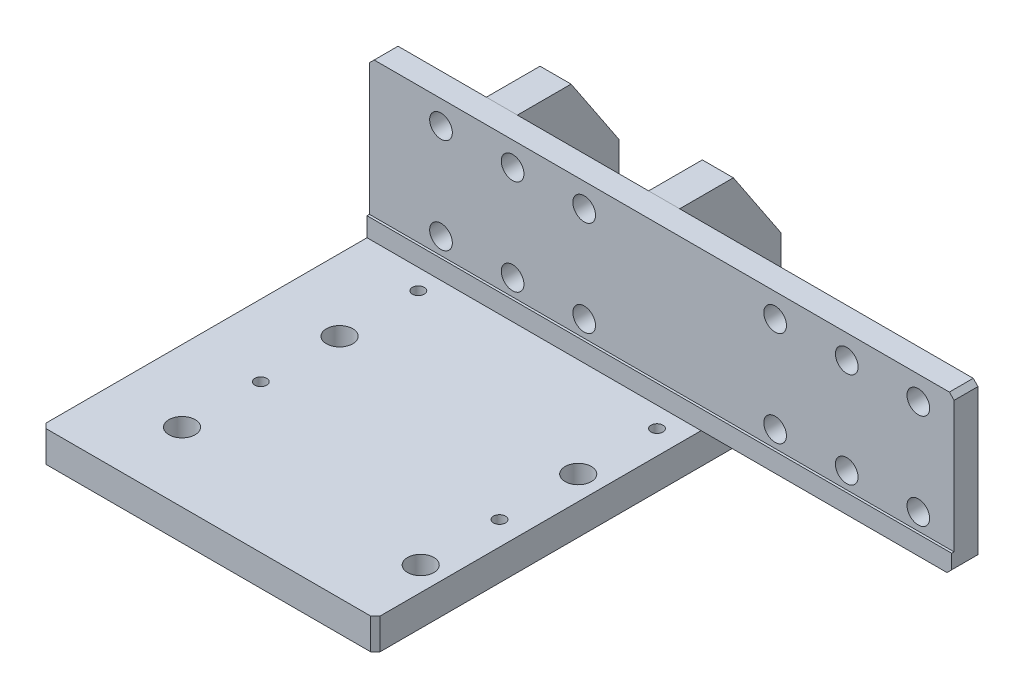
ISO-10303-21;
HEADER;
FILE_DESCRIPTION(('STEP AP214'),'2;1');
FILE_NAME('part.step','',(''),(''),'','','');
FILE_SCHEMA(('AUTOMOTIVE_DESIGN { 1 0 10303 214 1 1 1 1 }'));
ENDSEC;
DATA;
#1=APPLICATION_CONTEXT('core data for automotive mechanical design processes');
#2=APPLICATION_PROTOCOL_DEFINITION('international standard','automotive_design',2000,#1);
#3=PRODUCT_CONTEXT('',#1,'mechanical');
#4=PRODUCT('Part','Part','',(#3));
#5=PRODUCT_RELATED_PRODUCT_CATEGORY('part','',(#4));
#6=PRODUCT_DEFINITION_FORMATION('','',#4);
#7=PRODUCT_DEFINITION_CONTEXT('part definition',#1,'design');
#8=PRODUCT_DEFINITION('design','',#6,#7);
#9=PRODUCT_DEFINITION_SHAPE('','',#8);
#10=(LENGTH_UNIT() NAMED_UNIT(*) SI_UNIT(.MILLI.,.METRE.));
#11=(NAMED_UNIT(*) PLANE_ANGLE_UNIT() SI_UNIT($,.RADIAN.));
#12=(NAMED_UNIT(*) SI_UNIT($,.STERADIAN.) SOLID_ANGLE_UNIT());
#13=UNCERTAINTY_MEASURE_WITH_UNIT(LENGTH_MEASURE(1.E-05),#10,'distance_accuracy_value','');
#14=(GEOMETRIC_REPRESENTATION_CONTEXT(3) GLOBAL_UNCERTAINTY_ASSIGNED_CONTEXT((#13)) GLOBAL_UNIT_ASSIGNED_CONTEXT((#10,
#11,#12)) REPRESENTATION_CONTEXT('',''));
#15=CARTESIAN_POINT('',(0.,0.,0.));
#16=DIRECTION('',(0.,0.,1.));
#17=DIRECTION('',(1.,0.,0.));
#18=AXIS2_PLACEMENT_3D('',#15,#16,#17);
#19=CARTESIAN_POINT('',(37.,78.,-95.));
#20=DIRECTION('',(1.,0.,0.));
#21=DIRECTION('',(0.,0.,-1.));
#22=AXIS2_PLACEMENT_3D('',#19,#20,#21);
#23=PLANE('',#22);
#24=DIRECTION('',(0.,0.,1.));
#25=VECTOR('',#24,1.);
#26=CARTESIAN_POINT('',(37.,78.,-95.));
#27=LINE('',#26,#25);
#28=CARTESIAN_POINT('',(37.,78.,-75.));
#29=VERTEX_POINT('',#28);
#30=CARTESIAN_POINT('',(37.,78.,-52.5));
#31=VERTEX_POINT('',#30);
#32=EDGE_CURVE('E103',#29,#31,#27,.T.);
#33=ORIENTED_EDGE('',*,*,#32,.F.);
#34=DIRECTION('',(0.,-0.832050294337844,-0.554700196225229));
#35=VECTOR('',#34,1.);
#36=CARTESIAN_POINT('',(37.,68.7692307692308,-81.1538461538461));
#37=LINE('',#36,#35);
#38=CARTESIAN_POINT('',(37.,48.,-95.));
#39=VERTEX_POINT('',#38);
#40=EDGE_CURVE('E57',#29,#39,#37,.T.);
#41=ORIENTED_EDGE('',*,*,#40,.T.);
#42=DIRECTION('',(0.,-1.,0.));
#43=VECTOR('',#42,1.);
#44=CARTESIAN_POINT('',(37.,78.,-95.));
#45=LINE('',#44,#43);
#46=CARTESIAN_POINT('',(37.,13.,-95.));
#47=VERTEX_POINT('',#46);
#48=EDGE_CURVE('E85',#39,#47,#45,.T.);
#49=ORIENTED_EDGE('',*,*,#48,.T.);
#50=DIRECTION('',(0.,0.,1.));
#51=VECTOR('',#50,1.);
#52=CARTESIAN_POINT('',(37.,13.,-95.));
#53=LINE('',#52,#51);
#54=CARTESIAN_POINT('',(37.,13.,-52.5));
#55=VERTEX_POINT('',#54);
#56=EDGE_CURVE('E90',#47,#55,#53,.T.);
#57=ORIENTED_EDGE('',*,*,#56,.T.);
#58=DIRECTION('',(0.,-1.,0.));
#59=VECTOR('',#58,1.);
#60=CARTESIAN_POINT('',(37.,78.,-52.5));
#61=LINE('',#60,#59);
#62=EDGE_CURVE('E51',#31,#55,#61,.T.);
#63=ORIENTED_EDGE('',*,*,#62,.F.);
#64=EDGE_LOOP('',(#33,#41,#49,#57,#63));
#65=FACE_BOUND('',#64,.T.);
#66=ADVANCED_FACE('F44',(#65),#23,.F.);
#67=CARTESIAN_POINT('',(37.,78.,-52.5));
#68=DIRECTION('',(0.,0.,-1.));
#69=DIRECTION('',(-1.,0.,0.));
#70=AXIS2_PLACEMENT_3D('',#67,#68,#69);
#71=PLANE('',#70);
#72=DIRECTION('',(1.,0.,0.));
#73=VECTOR('',#72,1.);
#74=CARTESIAN_POINT('',(37.,13.,-52.5));
#75=LINE('',#74,#73);
#76=CARTESIAN_POINT('',(50.,13.,-52.5));
#77=VERTEX_POINT('',#76);
#78=EDGE_CURVE('E107',#55,#77,#75,.T.);
#79=ORIENTED_EDGE('',*,*,#78,.T.);
#80=DIRECTION('',(0.,-1.,0.));
#81=VECTOR('',#80,1.);
#82=CARTESIAN_POINT('',(50.,78.,-52.5));
#83=LINE('',#82,#81);
#84=CARTESIAN_POINT('',(50.,78.,-52.5));
#85=VERTEX_POINT('',#84);
#86=EDGE_CURVE('E118',#85,#77,#83,.T.);
#87=ORIENTED_EDGE('',*,*,#86,.F.);
#88=DIRECTION('',(1.,0.,0.));
#89=VECTOR('',#88,1.);
#90=CARTESIAN_POINT('',(37.,78.,-52.5));
#91=LINE('',#90,#89);
#92=EDGE_CURVE('E66',#31,#85,#91,.T.);
#93=ORIENTED_EDGE('',*,*,#92,.F.);
#94=ORIENTED_EDGE('',*,*,#62,.T.);
#95=EDGE_LOOP('',(#79,#87,#93,#94));
#96=FACE_BOUND('',#95,.T.);
#97=ADVANCED_FACE('F121',(#96),#71,.F.);
#98=CARTESIAN_POINT('',(50.,78.,-95.));
#99=DIRECTION('',(-1.,0.,0.));
#100=DIRECTION('',(0.,0.,1.));
#101=AXIS2_PLACEMENT_3D('',#98,#99,#100);
#102=PLANE('',#101);
#103=DIRECTION('',(0.,-1.,0.));
#104=VECTOR('',#103,1.);
#105=CARTESIAN_POINT('',(50.,78.,-95.));
#106=LINE('',#105,#104);
#107=CARTESIAN_POINT('',(50.,48.,-95.));
#108=VERTEX_POINT('',#107);
#109=CARTESIAN_POINT('',(50.,13.,-95.));
#110=VERTEX_POINT('',#109);
#111=EDGE_CURVE('E93',#108,#110,#106,.T.);
#112=ORIENTED_EDGE('',*,*,#111,.F.);
#113=DIRECTION('',(0.,-0.832050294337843,-0.554700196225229));
#114=VECTOR('',#113,1.);
#115=CARTESIAN_POINT('',(50.,48.,-95.));
#116=LINE('',#115,#114);
#117=CARTESIAN_POINT('',(50.,78.,-75.));
#118=VERTEX_POINT('',#117);
#119=EDGE_CURVE('E125',#118,#108,#116,.T.);
#120=ORIENTED_EDGE('',*,*,#119,.F.);
#121=DIRECTION('',(0.,0.,-1.));
#122=VECTOR('',#121,1.);
#123=CARTESIAN_POINT('',(50.,78.,-95.));
#124=LINE('',#123,#122);
#125=EDGE_CURVE('E94',#85,#118,#124,.T.);
#126=ORIENTED_EDGE('',*,*,#125,.F.);
#127=ORIENTED_EDGE('',*,*,#86,.T.);
#128=DIRECTION('',(0.,0.,-1.));
#129=VECTOR('',#128,1.);
#130=CARTESIAN_POINT('',(50.,13.,-95.));
#131=LINE('',#130,#129);
#132=EDGE_CURVE('E104',#77,#110,#131,.T.);
#133=ORIENTED_EDGE('',*,*,#132,.T.);
#134=EDGE_LOOP('',(#112,#120,#126,#127,#133));
#135=FACE_BOUND('',#134,.T.);
#136=ADVANCED_FACE('F134',(#135),#102,.F.);
#137=CARTESIAN_POINT('',(37.,78.,-95.));
#138=DIRECTION('',(0.,0.,1.));
#139=DIRECTION('',(1.,0.,0.));
#140=AXIS2_PLACEMENT_3D('',#137,#138,#139);
#141=PLANE('',#140);
#142=ORIENTED_EDGE('',*,*,#48,.F.);
#143=DIRECTION('',(1.,0.,0.));
#144=VECTOR('',#143,1.);
#145=CARTESIAN_POINT('',(-70.,48.,-95.));
#146=LINE('',#145,#144);
#147=EDGE_CURVE('E111',#39,#108,#146,.T.);
#148=ORIENTED_EDGE('',*,*,#147,.T.);
#149=ORIENTED_EDGE('',*,*,#111,.T.);
#150=DIRECTION('',(-1.,0.,0.));
#151=VECTOR('',#150,1.);
#152=CARTESIAN_POINT('',(37.,13.,-95.));
#153=LINE('',#152,#151);
#154=EDGE_CURVE('E97',#110,#47,#153,.T.);
#155=ORIENTED_EDGE('',*,*,#154,.T.);
#156=EDGE_LOOP('',(#142,#148,#149,#155));
#157=FACE_BOUND('',#156,.T.);
#158=ADVANCED_FACE('F98',(#157),#141,.F.);
#159=CARTESIAN_POINT('',(0.,78.,0.));
#160=DIRECTION('',(0.,1.,0.));
#161=DIRECTION('',(0.,0.,1.));
#162=AXIS2_PLACEMENT_3D('',#159,#160,#161);
#163=PLANE('',#162);
#164=DIRECTION('',(1.,0.,0.));
#165=VECTOR('',#164,1.);
#166=CARTESIAN_POINT('',(0.,78.,-75.));
#167=LINE('',#166,#165);
#168=EDGE_CURVE('E12',#29,#118,#167,.T.);
#169=ORIENTED_EDGE('',*,*,#168,.F.);
#170=ORIENTED_EDGE('',*,*,#32,.T.);
#171=ORIENTED_EDGE('',*,*,#92,.T.);
#172=ORIENTED_EDGE('',*,*,#125,.T.);
#173=EDGE_LOOP('',(#169,#170,#171,#172));
#174=FACE_BOUND('',#173,.T.);
#175=ADVANCED_FACE('F135',(#174),#163,.T.);
#176=CARTESIAN_POINT('',(0.,13.,0.));
#177=DIRECTION('',(0.,1.,0.));
#178=DIRECTION('',(0.,0.,1.));
#179=AXIS2_PLACEMENT_3D('',#176,#177,#178);
#180=PLANE('',#179);
#181=ORIENTED_EDGE('',*,*,#56,.F.);
#182=ORIENTED_EDGE('',*,*,#154,.F.);
#183=ORIENTED_EDGE('',*,*,#132,.F.);
#184=ORIENTED_EDGE('',*,*,#78,.F.);
#185=EDGE_LOOP('',(#181,#182,#183,#184));
#186=FACE_BOUND('',#185,.T.);
#187=ADVANCED_FACE('F106',(#186),#180,.F.);
#188=CARTESIAN_POINT('',(-70.,48.,-95.));
#189=DIRECTION('',(0.,-0.554700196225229,0.832050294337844));
#190=DIRECTION('',(0.,-0.832050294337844,-0.554700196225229));
#191=AXIS2_PLACEMENT_3D('',#188,#189,#190);
#192=PLANE('',#191);
#193=ORIENTED_EDGE('',*,*,#168,.T.);
#194=ORIENTED_EDGE('',*,*,#119,.T.);
#195=ORIENTED_EDGE('',*,*,#147,.F.);
#196=ORIENTED_EDGE('',*,*,#40,.F.);
#197=EDGE_LOOP('',(#193,#194,#195,#196));
#198=FACE_BOUND('',#197,.T.);
#199=ADVANCED_FACE('F129',(#198),#192,.F.);
#200=CLOSED_SHELL('',(#66,#97,#136,#158,#175,#187,#199));
#201=MANIFOLD_SOLID_BREP('B2',#200);
#202=CARTESIAN_POINT('',(-31.,78.,-95.));
#203=DIRECTION('',(1.,0.,0.));
#204=DIRECTION('',(0.,0.,-1.));
#205=AXIS2_PLACEMENT_3D('',#202,#203,#204);
#206=PLANE('',#205);
#207=DIRECTION('',(0.,0.,1.));
#208=VECTOR('',#207,1.);
#209=CARTESIAN_POINT('',(-31.,78.,-95.));
#210=LINE('',#209,#208);
#211=CARTESIAN_POINT('',(-31.,78.,-75.));
#212=VERTEX_POINT('',#211);
#213=CARTESIAN_POINT('',(-31.,78.,-52.5));
#214=VERTEX_POINT('',#213);
#215=EDGE_CURVE('E264',#212,#214,#210,.T.);
#216=ORIENTED_EDGE('',*,*,#215,.F.);
#217=DIRECTION('',(0.,-0.832050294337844,-0.554700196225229));
#218=VECTOR('',#217,1.);
#219=CARTESIAN_POINT('',(-31.,68.7692307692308,-81.1538461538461));
#220=LINE('',#219,#218);
#221=CARTESIAN_POINT('',(-31.,48.,-95.));
#222=VERTEX_POINT('',#221);
#223=EDGE_CURVE('E217',#212,#222,#220,.T.);
#224=ORIENTED_EDGE('',*,*,#223,.T.);
#225=DIRECTION('',(0.,-1.,0.));
#226=VECTOR('',#225,1.);
#227=CARTESIAN_POINT('',(-31.,78.,-95.));
#228=LINE('',#227,#226);
#229=CARTESIAN_POINT('',(-31.,13.,-95.));
#230=VERTEX_POINT('',#229);
#231=EDGE_CURVE('E245',#222,#230,#228,.T.);
#232=ORIENTED_EDGE('',*,*,#231,.T.);
#233=DIRECTION('',(0.,0.,1.));
#234=VECTOR('',#233,1.);
#235=CARTESIAN_POINT('',(-31.,13.,-95.));
#236=LINE('',#235,#234);
#237=CARTESIAN_POINT('',(-31.,13.,-52.5));
#238=VERTEX_POINT('',#237);
#239=EDGE_CURVE('E250',#230,#238,#236,.T.);
#240=ORIENTED_EDGE('',*,*,#239,.T.);
#241=DIRECTION('',(0.,-1.,0.));
#242=VECTOR('',#241,1.);
#243=CARTESIAN_POINT('',(-31.,78.,-52.5));
#244=LINE('',#243,#242);
#245=EDGE_CURVE('E211',#214,#238,#244,.T.);
#246=ORIENTED_EDGE('',*,*,#245,.F.);
#247=EDGE_LOOP('',(#216,#224,#232,#240,#246));
#248=FACE_BOUND('',#247,.T.);
#249=ADVANCED_FACE('F204',(#248),#206,.F.);
#250=CARTESIAN_POINT('',(-31.,78.,-52.5));
#251=DIRECTION('',(0.,0.,-1.));
#252=DIRECTION('',(-1.,0.,0.));
#253=AXIS2_PLACEMENT_3D('',#250,#251,#252);
#254=PLANE('',#253);
#255=DIRECTION('',(1.,0.,0.));
#256=VECTOR('',#255,1.);
#257=CARTESIAN_POINT('',(-31.,13.,-52.5));
#258=LINE('',#257,#256);
#259=CARTESIAN_POINT('',(-18.,13.,-52.5));
#260=VERTEX_POINT('',#259);
#261=EDGE_CURVE('E268',#238,#260,#258,.T.);
#262=ORIENTED_EDGE('',*,*,#261,.T.);
#263=DIRECTION('',(0.,-1.,0.));
#264=VECTOR('',#263,1.);
#265=CARTESIAN_POINT('',(-18.,78.,-52.5));
#266=LINE('',#265,#264);
#267=CARTESIAN_POINT('',(-18.,78.,-52.5));
#268=VERTEX_POINT('',#267);
#269=EDGE_CURVE('E279',#268,#260,#266,.T.);
#270=ORIENTED_EDGE('',*,*,#269,.F.);
#271=DIRECTION('',(1.,0.,0.));
#272=VECTOR('',#271,1.);
#273=CARTESIAN_POINT('',(-31.,78.,-52.5));
#274=LINE('',#273,#272);
#275=EDGE_CURVE('E226',#214,#268,#274,.T.);
#276=ORIENTED_EDGE('',*,*,#275,.F.);
#277=ORIENTED_EDGE('',*,*,#245,.T.);
#278=EDGE_LOOP('',(#262,#270,#276,#277));
#279=FACE_BOUND('',#278,.T.);
#280=ADVANCED_FACE('F282',(#279),#254,.F.);
#281=CARTESIAN_POINT('',(-18.,78.,-95.));
#282=DIRECTION('',(-1.,0.,0.));
#283=DIRECTION('',(0.,0.,1.));
#284=AXIS2_PLACEMENT_3D('',#281,#282,#283);
#285=PLANE('',#284);
#286=DIRECTION('',(0.,-1.,0.));
#287=VECTOR('',#286,1.);
#288=CARTESIAN_POINT('',(-18.,78.,-95.));
#289=LINE('',#288,#287);
#290=CARTESIAN_POINT('',(-18.,48.,-95.));
#291=VERTEX_POINT('',#290);
#292=CARTESIAN_POINT('',(-18.,13.,-95.));
#293=VERTEX_POINT('',#292);
#294=EDGE_CURVE('E254',#291,#293,#289,.T.);
#295=ORIENTED_EDGE('',*,*,#294,.F.);
#296=DIRECTION('',(0.,0.832050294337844,0.554700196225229));
#297=VECTOR('',#296,1.);
#298=CARTESIAN_POINT('',(-18.,68.7692307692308,-81.1538461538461));
#299=LINE('',#298,#297);
#300=CARTESIAN_POINT('',(-18.,78.,-75.));
#301=VERTEX_POINT('',#300);
#302=EDGE_CURVE('E272',#291,#301,#299,.T.);
#303=ORIENTED_EDGE('',*,*,#302,.T.);
#304=DIRECTION('',(0.,0.,-1.));
#305=VECTOR('',#304,1.);
#306=CARTESIAN_POINT('',(-18.,78.,-95.));
#307=LINE('',#306,#305);
#308=EDGE_CURVE('E255',#268,#301,#307,.T.);
#309=ORIENTED_EDGE('',*,*,#308,.F.);
#310=ORIENTED_EDGE('',*,*,#269,.T.);
#311=DIRECTION('',(0.,0.,-1.));
#312=VECTOR('',#311,1.);
#313=CARTESIAN_POINT('',(-18.,13.,-95.));
#314=LINE('',#313,#312);
#315=EDGE_CURVE('E265',#260,#293,#314,.T.);
#316=ORIENTED_EDGE('',*,*,#315,.T.);
#317=EDGE_LOOP('',(#295,#303,#309,#310,#316));
#318=FACE_BOUND('',#317,.T.);
#319=ADVANCED_FACE('F290',(#318),#285,.F.);
#320=CARTESIAN_POINT('',(-31.,78.,-95.));
#321=DIRECTION('',(0.,0.,1.));
#322=DIRECTION('',(1.,0.,0.));
#323=AXIS2_PLACEMENT_3D('',#320,#321,#322);
#324=PLANE('',#323);
#325=ORIENTED_EDGE('',*,*,#231,.F.);
#326=DIRECTION('',(1.,0.,0.));
#327=VECTOR('',#326,1.);
#328=CARTESIAN_POINT('',(-70.,48.,-95.));
#329=LINE('',#328,#327);
#330=EDGE_CURVE('E287',#222,#291,#329,.T.);
#331=ORIENTED_EDGE('',*,*,#330,.T.);
#332=ORIENTED_EDGE('',*,*,#294,.T.);
#333=DIRECTION('',(-1.,0.,0.));
#334=VECTOR('',#333,1.);
#335=CARTESIAN_POINT('',(-31.,13.,-95.));
#336=LINE('',#335,#334);
#337=EDGE_CURVE('E258',#293,#230,#336,.T.);
#338=ORIENTED_EDGE('',*,*,#337,.T.);
#339=EDGE_LOOP('',(#325,#331,#332,#338));
#340=FACE_BOUND('',#339,.T.);
#341=ADVANCED_FACE('F259',(#340),#324,.F.);
#342=CARTESIAN_POINT('',(0.,78.,0.));
#343=DIRECTION('',(0.,1.,0.));
#344=DIRECTION('',(0.,0.,1.));
#345=AXIS2_PLACEMENT_3D('',#342,#343,#344);
#346=PLANE('',#345);
#347=DIRECTION('',(1.,0.,0.));
#348=VECTOR('',#347,1.);
#349=CARTESIAN_POINT('',(0.,78.,-75.));
#350=LINE('',#349,#348);
#351=EDGE_CURVE('E42',#212,#301,#350,.T.);
#352=ORIENTED_EDGE('',*,*,#351,.F.);
#353=ORIENTED_EDGE('',*,*,#215,.T.);
#354=ORIENTED_EDGE('',*,*,#275,.T.);
#355=ORIENTED_EDGE('',*,*,#308,.T.);
#356=EDGE_LOOP('',(#352,#353,#354,#355));
#357=FACE_BOUND('',#356,.T.);
#358=ADVANCED_FACE('F293',(#357),#346,.T.);
#359=CARTESIAN_POINT('',(0.,13.,0.));
#360=DIRECTION('',(0.,1.,0.));
#361=DIRECTION('',(0.,0.,1.));
#362=AXIS2_PLACEMENT_3D('',#359,#360,#361);
#363=PLANE('',#362);
#364=ORIENTED_EDGE('',*,*,#239,.F.);
#365=ORIENTED_EDGE('',*,*,#337,.F.);
#366=ORIENTED_EDGE('',*,*,#315,.F.);
#367=ORIENTED_EDGE('',*,*,#261,.F.);
#368=EDGE_LOOP('',(#364,#365,#366,#367));
#369=FACE_BOUND('',#368,.T.);
#370=ADVANCED_FACE('F267',(#369),#363,.F.);
#371=CARTESIAN_POINT('',(-70.,48.,-95.));
#372=DIRECTION('',(0.,-0.554700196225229,0.832050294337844));
#373=DIRECTION('',(0.,-0.832050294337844,-0.554700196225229));
#374=AXIS2_PLACEMENT_3D('',#371,#372,#373);
#375=PLANE('',#374);
#376=ORIENTED_EDGE('',*,*,#351,.T.);
#377=ORIENTED_EDGE('',*,*,#302,.F.);
#378=ORIENTED_EDGE('',*,*,#330,.F.);
#379=ORIENTED_EDGE('',*,*,#223,.F.);
#380=EDGE_LOOP('',(#376,#377,#378,#379));
#381=FACE_BOUND('',#380,.T.);
#382=ADVANCED_FACE('F296',(#381),#375,.F.);
#383=CLOSED_SHELL('',(#249,#280,#319,#341,#358,#370,#382));
#384=MANIFOLD_SOLID_BREP('B6',#383);
#385=CARTESIAN_POINT('',(0.,78.,0.));
#386=DIRECTION('',(0.,-1.,0.));
#387=DIRECTION('',(0.,0.,-1.));
#388=AXIS2_PLACEMENT_3D('',#385,#386,#387);
#389=PLANE('',#388);
#390=DIRECTION('',(-1.,0.,0.));
#391=VECTOR('',#390,1.);
#392=CARTESIAN_POINT('',(-70.,78.,-42.5));
#393=LINE('',#392,#391);
#394=CARTESIAN_POINT('',(173.,78.,-42.5));
#395=VERTEX_POINT('',#394);
#396=CARTESIAN_POINT('',(-68.,78.,-42.5));
#397=VERTEX_POINT('',#396);
#398=EDGE_CURVE('E456',#395,#397,#393,.T.);
#399=ORIENTED_EDGE('',*,*,#398,.F.);
#400=DIRECTION('',(0.,0.,-1.));
#401=VECTOR('',#400,1.);
#402=CARTESIAN_POINT('',(173.,78.,0.));
#403=LINE('',#402,#401);
#404=CARTESIAN_POINT('',(173.,78.,-52.5));
#405=VERTEX_POINT('',#404);
#406=EDGE_CURVE('E513',#395,#405,#403,.T.);
#407=ORIENTED_EDGE('',*,*,#406,.T.);
#408=DIRECTION('',(-1.,0.,0.));
#409=VECTOR('',#408,1.);
#410=CARTESIAN_POINT('',(175.,78.,-52.5));
#411=LINE('',#410,#409);
#412=CARTESIAN_POINT('',(-68.,78.,-52.5));
#413=VERTEX_POINT('',#412);
#414=EDGE_CURVE('E463',#405,#413,#411,.T.);
#415=ORIENTED_EDGE('',*,*,#414,.T.);
#416=DIRECTION('',(0.,0.,1.));
#417=VECTOR('',#416,1.);
#418=CARTESIAN_POINT('',(-68.,78.,0.));
#419=LINE('',#418,#417);
#420=EDGE_CURVE('E481',#413,#397,#419,.T.);
#421=ORIENTED_EDGE('',*,*,#420,.T.);
#422=EDGE_LOOP('',(#399,#407,#415,#421));
#423=FACE_BOUND('',#422,.T.);
#424=ADVANCED_FACE('F363',(#423),#389,.F.);
#425=CARTESIAN_POINT('',(175.,78.,-52.5));
#426=DIRECTION('',(-1.,0.,0.));
#427=DIRECTION('',(0.,0.,1.));
#428=AXIS2_PLACEMENT_3D('',#425,#426,#427);
#429=PLANE('',#428);
#430=DIRECTION('',(0.,-1.,0.));
#431=VECTOR('',#430,1.);
#432=CARTESIAN_POINT('',(175.,78.,-52.5));
#433=LINE('',#432,#431);
#434=CARTESIAN_POINT('',(175.,76.,-52.5));
#435=VERTEX_POINT('',#434);
#436=CARTESIAN_POINT('',(175.,15.,-52.5));
#437=VERTEX_POINT('',#436);
#438=EDGE_CURVE('E478',#435,#437,#433,.T.);
#439=ORIENTED_EDGE('',*,*,#438,.F.);
#440=DIRECTION('',(0.,0.,1.));
#441=VECTOR('',#440,1.);
#442=CARTESIAN_POINT('',(175.,76.,-52.5));
#443=LINE('',#442,#441);
#444=CARTESIAN_POINT('',(175.,76.,-42.5));
#445=VERTEX_POINT('',#444);
#446=EDGE_CURVE('E525',#435,#445,#443,.T.);
#447=ORIENTED_EDGE('',*,*,#446,.T.);
#448=DIRECTION('',(0.,1.,0.));
#449=VECTOR('',#448,1.);
#450=CARTESIAN_POINT('',(175.,78.,-42.5));
#451=LINE('',#450,#449);
#452=CARTESIAN_POINT('',(175.,21.,-42.5));
#453=VERTEX_POINT('',#452);
#454=EDGE_CURVE('E450',#453,#445,#451,.T.);
#455=ORIENTED_EDGE('',*,*,#454,.F.);
#456=DIRECTION('',(0.,0.,1.));
#457=VECTOR('',#456,1.);
#458=CARTESIAN_POINT('',(175.,21.,-42.5));
#459=LINE('',#458,#457);
#460=CARTESIAN_POINT('',(175.,21.,-41.5));
#461=VERTEX_POINT('',#460);
#462=EDGE_CURVE('E449',#453,#461,#459,.T.);
#463=ORIENTED_EDGE('',*,*,#462,.T.);
#464=DIRECTION('',(0.,-1.,0.));
#465=VECTOR('',#464,1.);
#466=CARTESIAN_POINT('',(175.,78.,-41.5));
#467=LINE('',#466,#465);
#468=CARTESIAN_POINT('',(175.,15.,-41.5));
#469=VERTEX_POINT('',#468);
#470=EDGE_CURVE('E466',#461,#469,#467,.T.);
#471=ORIENTED_EDGE('',*,*,#470,.T.);
#472=DIRECTION('',(0.,0.,-1.));
#473=VECTOR('',#472,1.);
#474=CARTESIAN_POINT('',(175.,15.,-52.5));
#475=LINE('',#474,#473);
#476=EDGE_CURVE('E522',#469,#437,#475,.T.);
#477=ORIENTED_EDGE('',*,*,#476,.T.);
#478=EDGE_LOOP('',(#439,#447,#455,#463,#471,#477));
#479=FACE_BOUND('',#478,.T.);
#480=ADVANCED_FACE('F538',(#479),#429,.F.);
#481=CARTESIAN_POINT('',(175.,78.,-52.5));
#482=DIRECTION('',(0.,0.,1.));
#483=DIRECTION('',(1.,0.,0.));
#484=AXIS2_PLACEMENT_3D('',#481,#482,#483);
#485=PLANE('',#484);
#486=CARTESIAN_POINT('',(130.,68.,-52.5));
#487=DIRECTION('',(0.,0.,1.));
#488=DIRECTION('',(1.,0.,0.));
#489=AXIS2_PLACEMENT_3D('',#486,#487,#488);
#490=CIRCLE('',#489,2.75);
#491=CARTESIAN_POINT('',(132.75,68.,-52.5));
#492=VERTEX_POINT('',#491);
#493=EDGE_CURVE('E667',#492,#492,#490,.T.);
#494=ORIENTED_EDGE('',*,*,#493,.T.);
#495=EDGE_LOOP('',(#494));
#496=FACE_BOUND('',#495,.T.);
#497=CARTESIAN_POINT('',(160.,68.,-52.5));
#498=DIRECTION('',(0.,0.,1.));
#499=DIRECTION('',(1.,0.,0.));
#500=AXIS2_PLACEMENT_3D('',#497,#498,#499);
#501=CIRCLE('',#500,2.75);
#502=CARTESIAN_POINT('',(162.75,68.,-52.5));
#503=VERTEX_POINT('',#502);
#504=EDGE_CURVE('E655',#503,#503,#501,.T.);
#505=ORIENTED_EDGE('',*,*,#504,.T.);
#506=EDGE_LOOP('',(#505));
#507=FACE_BOUND('',#506,.T.);
#508=CARTESIAN_POINT('',(100.,28.,-52.5));
#509=DIRECTION('',(0.,0.,1.));
#510=DIRECTION('',(1.,0.,0.));
#511=AXIS2_PLACEMENT_3D('',#508,#509,#510);
#512=CIRCLE('',#511,2.75);
#513=CARTESIAN_POINT('',(102.75,28.,-52.5));
#514=VERTEX_POINT('',#513);
#515=EDGE_CURVE('E643',#514,#514,#512,.T.);
#516=ORIENTED_EDGE('',*,*,#515,.T.);
#517=EDGE_LOOP('',(#516));
#518=FACE_BOUND('',#517,.T.);
#519=CARTESIAN_POINT('',(130.,28.,-52.5));
#520=DIRECTION('',(0.,0.,1.));
#521=DIRECTION('',(1.,0.,0.));
#522=AXIS2_PLACEMENT_3D('',#519,#520,#521);
#523=CIRCLE('',#522,2.75);
#524=CARTESIAN_POINT('',(132.75,28.,-52.5));
#525=VERTEX_POINT('',#524);
#526=EDGE_CURVE('E631',#525,#525,#523,.T.);
#527=ORIENTED_EDGE('',*,*,#526,.T.);
#528=EDGE_LOOP('',(#527));
#529=FACE_BOUND('',#528,.T.);
#530=CARTESIAN_POINT('',(160.,28.,-52.5));
#531=DIRECTION('',(0.,0.,1.));
#532=DIRECTION('',(1.,0.,0.));
#533=AXIS2_PLACEMENT_3D('',#530,#531,#532);
#534=CIRCLE('',#533,2.75);
#535=CARTESIAN_POINT('',(162.75,28.,-52.5));
#536=VERTEX_POINT('',#535);
#537=EDGE_CURVE('E619',#536,#536,#534,.T.);
#538=ORIENTED_EDGE('',*,*,#537,.T.);
#539=EDGE_LOOP('',(#538));
#540=FACE_BOUND('',#539,.T.);
#541=CARTESIAN_POINT('',(100.,68.,-52.5));
#542=DIRECTION('',(0.,0.,1.));
#543=DIRECTION('',(1.,0.,0.));
#544=AXIS2_PLACEMENT_3D('',#541,#542,#543);
#545=CIRCLE('',#544,2.75);
#546=CARTESIAN_POINT('',(102.75,68.,-52.5));
#547=VERTEX_POINT('',#546);
#548=EDGE_CURVE('E607',#547,#547,#545,.T.);
#549=ORIENTED_EDGE('',*,*,#548,.T.);
#550=EDGE_LOOP('',(#549));
#551=FACE_BOUND('',#550,.T.);
#552=CARTESIAN_POINT('',(-40.,68.,-52.5));
#553=DIRECTION('',(0.,0.,1.));
#554=DIRECTION('',(1.,0.,0.));
#555=AXIS2_PLACEMENT_3D('',#552,#553,#554);
#556=CIRCLE('',#555,2.75);
#557=CARTESIAN_POINT('',(-37.25,68.,-52.5));
#558=VERTEX_POINT('',#557);
#559=EDGE_CURVE('E506',#558,#558,#556,.T.);
#560=ORIENTED_EDGE('',*,*,#559,.T.);
#561=EDGE_LOOP('',(#560));
#562=FACE_BOUND('',#561,.T.);
#563=CARTESIAN_POINT('',(-10.,68.,-52.5));
#564=DIRECTION('',(0.,0.,1.));
#565=DIRECTION('',(1.,0.,0.));
#566=AXIS2_PLACEMENT_3D('',#563,#564,#565);
#567=CIRCLE('',#566,2.75);
#568=CARTESIAN_POINT('',(-7.25000000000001,68.,-52.5));
#569=VERTEX_POINT('',#568);
#570=EDGE_CURVE('E501',#569,#569,#567,.T.);
#571=ORIENTED_EDGE('',*,*,#570,.T.);
#572=EDGE_LOOP('',(#571));
#573=FACE_BOUND('',#572,.T.);
#574=CARTESIAN_POINT('',(20.,68.,-52.5));
#575=DIRECTION('',(0.,0.,1.));
#576=DIRECTION('',(1.,0.,0.));
#577=AXIS2_PLACEMENT_3D('',#574,#575,#576);
#578=CIRCLE('',#577,2.75);
#579=CARTESIAN_POINT('',(22.75,68.,-52.5));
#580=VERTEX_POINT('',#579);
#581=EDGE_CURVE('E496',#580,#580,#578,.T.);
#582=ORIENTED_EDGE('',*,*,#581,.T.);
#583=EDGE_LOOP('',(#582));
#584=FACE_BOUND('',#583,.T.);
#585=CARTESIAN_POINT('',(-40.,28.,-52.5));
#586=DIRECTION('',(0.,0.,1.));
#587=DIRECTION('',(1.,0.,0.));
#588=AXIS2_PLACEMENT_3D('',#585,#586,#587);
#589=CIRCLE('',#588,2.75);
#590=CARTESIAN_POINT('',(-37.25,28.,-52.5));
#591=VERTEX_POINT('',#590);
#592=EDGE_CURVE('E491',#591,#591,#589,.T.);
#593=ORIENTED_EDGE('',*,*,#592,.T.);
#594=EDGE_LOOP('',(#593));
#595=FACE_BOUND('',#594,.T.);
#596=CARTESIAN_POINT('',(-10.,28.,-52.5));
#597=DIRECTION('',(0.,0.,1.));
#598=DIRECTION('',(1.,0.,0.));
#599=AXIS2_PLACEMENT_3D('',#596,#597,#598);
#600=CIRCLE('',#599,2.75);
#601=CARTESIAN_POINT('',(-7.25000000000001,28.,-52.5));
#602=VERTEX_POINT('',#601);
#603=EDGE_CURVE('E486',#602,#602,#600,.T.);
#604=ORIENTED_EDGE('',*,*,#603,.T.);
#605=EDGE_LOOP('',(#604));
#606=FACE_BOUND('',#605,.T.);
#607=CARTESIAN_POINT('',(20.,28.,-52.5));
#608=DIRECTION('',(0.,0.,1.));
#609=DIRECTION('',(1.,0.,0.));
#610=AXIS2_PLACEMENT_3D('',#607,#608,#609);
#611=CIRCLE('',#610,2.75);
#612=CARTESIAN_POINT('',(22.75,28.,-52.5));
#613=VERTEX_POINT('',#612);
#614=EDGE_CURVE('E482',#613,#613,#611,.T.);
#615=ORIENTED_EDGE('',*,*,#614,.T.);
#616=EDGE_LOOP('',(#615));
#617=FACE_BOUND('',#616,.T.);
#618=ORIENTED_EDGE('',*,*,#414,.F.);
#619=DIRECTION('',(-0.707106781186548,0.707106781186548,0.));
#620=VECTOR('',#619,1.);
#621=CARTESIAN_POINT('',(173.,78.,-52.5));
#622=LINE('',#621,#620);
#623=EDGE_CURVE('E520',#405,#435,#622,.F.);
#624=ORIENTED_EDGE('',*,*,#623,.T.);
#625=ORIENTED_EDGE('',*,*,#438,.T.);
#626=DIRECTION('',(-0.707106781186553,-0.707106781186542,0.));
#627=VECTOR('',#626,1.);
#628=CARTESIAN_POINT('',(175.,15.,-52.5));
#629=LINE('',#628,#627);
#630=CARTESIAN_POINT('',(173.,13.,-52.5));
#631=VERTEX_POINT('',#630);
#632=EDGE_CURVE('E518',#437,#631,#629,.T.);
#633=ORIENTED_EDGE('',*,*,#632,.T.);
#634=DIRECTION('',(-1.,0.,0.));
#635=VECTOR('',#634,1.);
#636=CARTESIAN_POINT('',(175.,13.,-52.5));
#637=LINE('',#636,#635);
#638=CARTESIAN_POINT('',(-70.,13.,-52.5));
#639=VERTEX_POINT('',#638);
#640=EDGE_CURVE('E458',#631,#639,#637,.T.);
#641=ORIENTED_EDGE('',*,*,#640,.T.);
#642=DIRECTION('',(0.,-1.,0.));
#643=VECTOR('',#642,1.);
#644=CARTESIAN_POINT('',(-70.,78.,-52.5));
#645=LINE('',#644,#643);
#646=CARTESIAN_POINT('',(-70.,76.,-52.5));
#647=VERTEX_POINT('',#646);
#648=EDGE_CURVE('E476',#647,#639,#645,.T.);
#649=ORIENTED_EDGE('',*,*,#648,.F.);
#650=DIRECTION('',(-0.707106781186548,-0.707106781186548,0.));
#651=VECTOR('',#650,1.);
#652=CARTESIAN_POINT('',(-68.,78.,-52.5));
#653=LINE('',#652,#651);
#654=EDGE_CURVE('E516',#647,#413,#653,.F.);
#655=ORIENTED_EDGE('',*,*,#654,.T.);
#656=EDGE_LOOP('',(#618,#624,#625,#633,#641,#649,#655));
#657=FACE_BOUND('',#656,.T.);
#658=ADVANCED_FACE('F542',(#496,#507,#518,#529,#540,#551,#562,#573,#584,#595,#606,#617,#657),
#485,.F.);
#659=CARTESIAN_POINT('',(-70.,78.,-52.5));
#660=DIRECTION('',(1.,0.,0.));
#661=DIRECTION('',(0.,0.,-1.));
#662=AXIS2_PLACEMENT_3D('',#659,#660,#661);
#663=PLANE('',#662);
#664=DIRECTION('',(0.,-1.,0.));
#665=VECTOR('',#664,1.);
#666=CARTESIAN_POINT('',(-70.,78.,-42.5));
#667=LINE('',#666,#665);
#668=CARTESIAN_POINT('',(-70.,76.,-42.5));
#669=VERTEX_POINT('',#668);
#670=CARTESIAN_POINT('',(-70.,21.,-42.5));
#671=VERTEX_POINT('',#670);
#672=EDGE_CURVE('E433',#669,#671,#667,.T.);
#673=ORIENTED_EDGE('',*,*,#672,.F.);
#674=DIRECTION('',(0.,0.,-1.));
#675=VECTOR('',#674,1.);
#676=CARTESIAN_POINT('',(-70.,76.,-52.5));
#677=LINE('',#676,#675);
#678=EDGE_CURVE('E202',#669,#647,#677,.T.);
#679=ORIENTED_EDGE('',*,*,#678,.T.);
#680=ORIENTED_EDGE('',*,*,#648,.T.);
#681=DIRECTION('',(0.,0.,1.));
#682=VECTOR('',#681,1.);
#683=CARTESIAN_POINT('',(-70.,13.,-52.5));
#684=LINE('',#683,#682);
#685=CARTESIAN_POINT('',(-70.,13.,-41.4999999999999));
#686=VERTEX_POINT('',#685);
#687=EDGE_CURVE('E470',#639,#686,#684,.T.);
#688=ORIENTED_EDGE('',*,*,#687,.T.);
#689=DIRECTION('',(0.,-1.,0.));
#690=VECTOR('',#689,1.);
#691=CARTESIAN_POINT('',(-70.,78.,-41.4999999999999));
#692=LINE('',#691,#690);
#693=CARTESIAN_POINT('',(-70.,21.,-41.5));
#694=VERTEX_POINT('',#693);
#695=EDGE_CURVE('E455',#694,#686,#692,.T.);
#696=ORIENTED_EDGE('',*,*,#695,.F.);
#697=DIRECTION('',(0.,0.,1.));
#698=VECTOR('',#697,1.);
#699=CARTESIAN_POINT('',(-70.,21.,-42.5));
#700=LINE('',#699,#698);
#701=EDGE_CURVE('E446',#671,#694,#700,.T.);
#702=ORIENTED_EDGE('',*,*,#701,.F.);
#703=EDGE_LOOP('',(#673,#679,#680,#688,#696,#702));
#704=FACE_BOUND('',#703,.T.);
#705=ADVANCED_FACE('F453',(#704),#663,.F.);
#706=CARTESIAN_POINT('',(175.,78.,-41.5));
#707=DIRECTION('',(0.,0.,-1.));
#708=DIRECTION('',(-1.,0.,0.));
#709=AXIS2_PLACEMENT_3D('',#706,#707,#708);
#710=PLANE('',#709);
#711=DIRECTION('',(1.,0.,0.));
#712=VECTOR('',#711,1.);
#713=CARTESIAN_POINT('',(175.,13.,-41.5));
#714=LINE('',#713,#712);
#715=CARTESIAN_POINT('',(173.,13.,-41.5));
#716=VERTEX_POINT('',#715);
#717=EDGE_CURVE('E467',#686,#716,#714,.T.);
#718=ORIENTED_EDGE('',*,*,#717,.T.);
#719=DIRECTION('',(0.707106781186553,0.707106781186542,0.));
#720=VECTOR('',#719,1.);
#721=CARTESIAN_POINT('',(175.,15.,-41.5));
#722=LINE('',#721,#720);
#723=EDGE_CURVE('E371',#716,#469,#722,.T.);
#724=ORIENTED_EDGE('',*,*,#723,.T.);
#725=ORIENTED_EDGE('',*,*,#470,.F.);
#726=DIRECTION('',(1.,0.,0.));
#727=VECTOR('',#726,1.);
#728=CARTESIAN_POINT('',(-70.,21.,-41.5));
#729=LINE('',#728,#727);
#730=EDGE_CURVE('E442',#694,#461,#729,.T.);
#731=ORIENTED_EDGE('',*,*,#730,.F.);
#732=ORIENTED_EDGE('',*,*,#695,.T.);
#733=EDGE_LOOP('',(#718,#724,#725,#731,#732));
#734=FACE_BOUND('',#733,.T.);
#735=ADVANCED_FACE('F533',(#734),#710,.F.);
#736=CARTESIAN_POINT('',(0.,13.,0.));
#737=DIRECTION('',(0.,-1.,0.));
#738=DIRECTION('',(0.,0.,-1.));
#739=AXIS2_PLACEMENT_3D('',#736,#737,#738);
#740=PLANE('',#739);
#741=ORIENTED_EDGE('',*,*,#640,.F.);
#742=DIRECTION('',(0.,0.,1.));
#743=VECTOR('',#742,1.);
#744=CARTESIAN_POINT('',(173.,13.,-41.5));
#745=LINE('',#744,#743);
#746=EDGE_CURVE('E378',#631,#716,#745,.T.);
#747=ORIENTED_EDGE('',*,*,#746,.T.);
#748=ORIENTED_EDGE('',*,*,#717,.F.);
#749=ORIENTED_EDGE('',*,*,#687,.F.);
#750=EDGE_LOOP('',(#741,#747,#748,#749));
#751=FACE_BOUND('',#750,.T.);
#752=ADVANCED_FACE('F545',(#751),#740,.T.);
#753=CARTESIAN_POINT('',(-70.,21.,-42.5));
#754=DIRECTION('',(0.,-1.,0.));
#755=DIRECTION('',(0.,0.,-1.));
#756=AXIS2_PLACEMENT_3D('',#753,#754,#755);
#757=PLANE('',#756);
#758=ORIENTED_EDGE('',*,*,#730,.T.);
#759=ORIENTED_EDGE('',*,*,#462,.F.);
#760=DIRECTION('',(1.,0.,0.));
#761=VECTOR('',#760,1.);
#762=CARTESIAN_POINT('',(-70.,21.,-42.5));
#763=LINE('',#762,#761);
#764=EDGE_CURVE('E437',#671,#453,#763,.T.);
#765=ORIENTED_EDGE('',*,*,#764,.F.);
#766=ORIENTED_EDGE('',*,*,#701,.T.);
#767=EDGE_LOOP('',(#758,#759,#765,#766));
#768=FACE_BOUND('',#767,.T.);
#769=ADVANCED_FACE('F445',(#768),#757,.F.);
#770=CARTESIAN_POINT('',(0.,0.,-42.5));
#771=DIRECTION('',(0.,0.,1.));
#772=DIRECTION('',(1.,0.,0.));
#773=AXIS2_PLACEMENT_3D('',#770,#771,#772);
#774=PLANE('',#773);
#775=CARTESIAN_POINT('',(130.,68.,-42.5));
#776=DIRECTION('',(0.,0.,1.));
#777=DIRECTION('',(1.,0.,0.));
#778=AXIS2_PLACEMENT_3D('',#775,#776,#777);
#779=CIRCLE('',#778,4.75);
#780=CARTESIAN_POINT('',(134.75,68.,-42.5));
#781=VERTEX_POINT('',#780);
#782=EDGE_CURVE('E670',#781,#781,#779,.T.);
#783=ORIENTED_EDGE('',*,*,#782,.F.);
#784=EDGE_LOOP('',(#783));
#785=FACE_BOUND('',#784,.T.);
#786=CARTESIAN_POINT('',(160.,68.,-42.5));
#787=DIRECTION('',(0.,0.,1.));
#788=DIRECTION('',(1.,0.,0.));
#789=AXIS2_PLACEMENT_3D('',#786,#787,#788);
#790=CIRCLE('',#789,4.75);
#791=CARTESIAN_POINT('',(164.75,68.,-42.5));
#792=VERTEX_POINT('',#791);
#793=EDGE_CURVE('E658',#792,#792,#790,.T.);
#794=ORIENTED_EDGE('',*,*,#793,.F.);
#795=EDGE_LOOP('',(#794));
#796=FACE_BOUND('',#795,.T.);
#797=CARTESIAN_POINT('',(100.,28.,-42.5));
#798=DIRECTION('',(0.,0.,1.));
#799=DIRECTION('',(1.,0.,0.));
#800=AXIS2_PLACEMENT_3D('',#797,#798,#799);
#801=CIRCLE('',#800,4.75);
#802=CARTESIAN_POINT('',(104.75,28.,-42.5));
#803=VERTEX_POINT('',#802);
#804=EDGE_CURVE('E646',#803,#803,#801,.T.);
#805=ORIENTED_EDGE('',*,*,#804,.F.);
#806=EDGE_LOOP('',(#805));
#807=FACE_BOUND('',#806,.T.);
#808=CARTESIAN_POINT('',(130.,28.,-42.5));
#809=DIRECTION('',(0.,0.,1.));
#810=DIRECTION('',(1.,0.,0.));
#811=AXIS2_PLACEMENT_3D('',#808,#809,#810);
#812=CIRCLE('',#811,4.75);
#813=CARTESIAN_POINT('',(134.75,28.,-42.5));
#814=VERTEX_POINT('',#813);
#815=EDGE_CURVE('E634',#814,#814,#812,.T.);
#816=ORIENTED_EDGE('',*,*,#815,.F.);
#817=EDGE_LOOP('',(#816));
#818=FACE_BOUND('',#817,.T.);
#819=CARTESIAN_POINT('',(160.,28.,-42.5));
#820=DIRECTION('',(0.,0.,1.));
#821=DIRECTION('',(1.,0.,0.));
#822=AXIS2_PLACEMENT_3D('',#819,#820,#821);
#823=CIRCLE('',#822,4.75);
#824=CARTESIAN_POINT('',(164.75,28.,-42.5));
#825=VERTEX_POINT('',#824);
#826=EDGE_CURVE('E622',#825,#825,#823,.T.);
#827=ORIENTED_EDGE('',*,*,#826,.F.);
#828=EDGE_LOOP('',(#827));
#829=FACE_BOUND('',#828,.T.);
#830=CARTESIAN_POINT('',(100.,68.,-42.5));
#831=DIRECTION('',(0.,0.,1.));
#832=DIRECTION('',(1.,0.,0.));
#833=AXIS2_PLACEMENT_3D('',#830,#831,#832);
#834=CIRCLE('',#833,4.75);
#835=CARTESIAN_POINT('',(104.75,68.,-42.5));
#836=VERTEX_POINT('',#835);
#837=EDGE_CURVE('E610',#836,#836,#834,.T.);
#838=ORIENTED_EDGE('',*,*,#837,.F.);
#839=EDGE_LOOP('',(#838));
#840=FACE_BOUND('',#839,.T.);
#841=CARTESIAN_POINT('',(-40.,68.,-42.5));
#842=DIRECTION('',(0.,0.,1.));
#843=DIRECTION('',(1.,0.,0.));
#844=AXIS2_PLACEMENT_3D('',#841,#842,#843);
#845=CIRCLE('',#844,4.75);
#846=CARTESIAN_POINT('',(-35.25,68.,-42.5));
#847=VERTEX_POINT('',#846);
#848=EDGE_CURVE('E598',#847,#847,#845,.T.);
#849=ORIENTED_EDGE('',*,*,#848,.F.);
#850=EDGE_LOOP('',(#849));
#851=FACE_BOUND('',#850,.T.);
#852=CARTESIAN_POINT('',(-10.,68.,-42.5));
#853=DIRECTION('',(0.,0.,1.));
#854=DIRECTION('',(1.,0.,0.));
#855=AXIS2_PLACEMENT_3D('',#852,#853,#854);
#856=CIRCLE('',#855,4.75);
#857=CARTESIAN_POINT('',(-5.25000000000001,68.,-42.5));
#858=VERTEX_POINT('',#857);
#859=EDGE_CURVE('E509',#858,#858,#856,.T.);
#860=ORIENTED_EDGE('',*,*,#859,.F.);
#861=EDGE_LOOP('',(#860));
#862=FACE_BOUND('',#861,.T.);
#863=CARTESIAN_POINT('',(20.,68.,-42.5));
#864=DIRECTION('',(0.,0.,1.));
#865=DIRECTION('',(1.,0.,0.));
#866=AXIS2_PLACEMENT_3D('',#863,#864,#865);
#867=CIRCLE('',#866,4.75);
#868=CARTESIAN_POINT('',(24.75,68.,-42.5));
#869=VERTEX_POINT('',#868);
#870=EDGE_CURVE('E504',#869,#869,#867,.T.);
#871=ORIENTED_EDGE('',*,*,#870,.F.);
#872=EDGE_LOOP('',(#871));
#873=FACE_BOUND('',#872,.T.);
#874=CARTESIAN_POINT('',(-40.,28.,-42.5));
#875=DIRECTION('',(0.,0.,1.));
#876=DIRECTION('',(1.,0.,0.));
#877=AXIS2_PLACEMENT_3D('',#874,#875,#876);
#878=CIRCLE('',#877,4.75);
#879=CARTESIAN_POINT('',(-35.25,28.,-42.5));
#880=VERTEX_POINT('',#879);
#881=EDGE_CURVE('E499',#880,#880,#878,.T.);
#882=ORIENTED_EDGE('',*,*,#881,.F.);
#883=EDGE_LOOP('',(#882));
#884=FACE_BOUND('',#883,.T.);
#885=CARTESIAN_POINT('',(-10.,28.,-42.5));
#886=DIRECTION('',(0.,0.,1.));
#887=DIRECTION('',(1.,0.,0.));
#888=AXIS2_PLACEMENT_3D('',#885,#886,#887);
#889=CIRCLE('',#888,4.75);
#890=CARTESIAN_POINT('',(-5.25000000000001,28.,-42.5));
#891=VERTEX_POINT('',#890);
#892=EDGE_CURVE('E494',#891,#891,#889,.T.);
#893=ORIENTED_EDGE('',*,*,#892,.F.);
#894=EDGE_LOOP('',(#893));
#895=FACE_BOUND('',#894,.T.);
#896=CARTESIAN_POINT('',(20.,28.,-42.5));
#897=DIRECTION('',(0.,0.,1.));
#898=DIRECTION('',(1.,0.,0.));
#899=AXIS2_PLACEMENT_3D('',#896,#897,#898);
#900=CIRCLE('',#899,4.75);
#901=CARTESIAN_POINT('',(24.75,28.,-42.5));
#902=VERTEX_POINT('',#901);
#903=EDGE_CURVE('E489',#902,#902,#900,.T.);
#904=ORIENTED_EDGE('',*,*,#903,.F.);
#905=EDGE_LOOP('',(#904));
#906=FACE_BOUND('',#905,.T.);
#907=ORIENTED_EDGE('',*,*,#454,.T.);
#908=DIRECTION('',(0.707106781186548,-0.707106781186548,0.));
#909=VECTOR('',#908,1.);
#910=CARTESIAN_POINT('',(125.5,125.5,-42.5));
#911=LINE('',#910,#909);
#912=EDGE_CURVE('E528',#445,#395,#911,.F.);
#913=ORIENTED_EDGE('',*,*,#912,.T.);
#914=ORIENTED_EDGE('',*,*,#398,.T.);
#915=DIRECTION('',(0.707106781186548,0.707106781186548,0.));
#916=VECTOR('',#915,1.);
#917=CARTESIAN_POINT('',(-73.,73.,-42.5));
#918=LINE('',#917,#916);
#919=EDGE_CURVE('E386',#397,#669,#918,.F.);
#920=ORIENTED_EDGE('',*,*,#919,.T.);
#921=ORIENTED_EDGE('',*,*,#672,.T.);
#922=ORIENTED_EDGE('',*,*,#764,.T.);
#923=EDGE_LOOP('',(#907,#913,#914,#920,#921,#922));
#924=FACE_BOUND('',#923,.T.);
#925=ADVANCED_FACE('F436',(#785,#796,#807,#818,#829,#840,#851,#862,#873,#884,#895,#906,#924),
#774,.T.);
#926=CARTESIAN_POINT('',(20.,28.,-42.5));
#927=DIRECTION('',(0.,0.,1.));
#928=DIRECTION('',(1.,0.,0.));
#929=AXIS2_PLACEMENT_3D('',#926,#927,#928);
#930=CYLINDRICAL_SURFACE('',#929,2.75);
#931=CARTESIAN_POINT('',(20.,28.,-50.5));
#932=DIRECTION('',(0.,0.,1.));
#933=DIRECTION('',(1.,0.,0.));
#934=AXIS2_PLACEMENT_3D('',#931,#932,#933);
#935=CIRCLE('',#934,2.75);
#936=CARTESIAN_POINT('',(22.75,28.,-50.5));
#937=VERTEX_POINT('',#936);
#938=EDGE_CURVE('E485',#937,#937,#935,.T.);
#939=ORIENTED_EDGE('',*,*,#938,.T.);
#940=EDGE_LOOP('',(#939));
#941=FACE_BOUND('',#940,.T.);
#942=ORIENTED_EDGE('',*,*,#614,.F.);
#943=EDGE_LOOP('',(#942));
#944=FACE_BOUND('',#943,.T.);
#945=ADVANCED_FACE('F678',(#941,#944),#930,.F.);
#946=CARTESIAN_POINT('',(22.75,28.,-50.5));
#947=DIRECTION('',(0.,0.,-1.));
#948=DIRECTION('',(-1.,0.,0.));
#949=AXIS2_PLACEMENT_3D('',#946,#947,#948);
#950=PLANE('',#949);
#951=ORIENTED_EDGE('',*,*,#938,.F.);
#952=EDGE_LOOP('',(#951));
#953=FACE_BOUND('',#952,.T.);
#954=CARTESIAN_POINT('',(20.,28.,-50.5));
#955=DIRECTION('',(0.,0.,1.));
#956=DIRECTION('',(1.,0.,0.));
#957=AXIS2_PLACEMENT_3D('',#954,#955,#956);
#958=CIRCLE('',#957,4.75);
#959=CARTESIAN_POINT('',(24.75,28.,-50.5));
#960=VERTEX_POINT('',#959);
#961=EDGE_CURVE('E560',#960,#960,#958,.T.);
#962=ORIENTED_EDGE('',*,*,#961,.T.);
#963=EDGE_LOOP('',(#962));
#964=FACE_BOUND('',#963,.T.);
#965=ADVANCED_FACE('F705',(#953,#964),#950,.F.);
#966=CARTESIAN_POINT('',(20.,28.,-42.5));
#967=DIRECTION('',(0.,0.,1.));
#968=DIRECTION('',(1.,0.,0.));
#969=AXIS2_PLACEMENT_3D('',#966,#967,#968);
#970=CYLINDRICAL_SURFACE('',#969,4.75);
#971=ORIENTED_EDGE('',*,*,#961,.F.);
#972=EDGE_LOOP('',(#971));
#973=FACE_BOUND('',#972,.T.);
#974=ORIENTED_EDGE('',*,*,#903,.T.);
#975=EDGE_LOOP('',(#974));
#976=FACE_BOUND('',#975,.T.);
#977=ADVANCED_FACE('F702',(#973,#976),#970,.F.);
#978=CARTESIAN_POINT('',(-10.,28.,-42.5));
#979=DIRECTION('',(0.,0.,1.));
#980=DIRECTION('',(1.,0.,0.));
#981=AXIS2_PLACEMENT_3D('',#978,#979,#980);
#982=CYLINDRICAL_SURFACE('',#981,2.75);
#983=CARTESIAN_POINT('',(-10.,28.,-50.5));
#984=DIRECTION('',(0.,0.,1.));
#985=DIRECTION('',(1.,0.,0.));
#986=AXIS2_PLACEMENT_3D('',#983,#984,#985);
#987=CIRCLE('',#986,2.75);
#988=CARTESIAN_POINT('',(-7.25,28.,-50.5));
#989=VERTEX_POINT('',#988);
#990=EDGE_CURVE('E490',#989,#989,#987,.T.);
#991=ORIENTED_EDGE('',*,*,#990,.T.);
#992=EDGE_LOOP('',(#991));
#993=FACE_BOUND('',#992,.T.);
#994=ORIENTED_EDGE('',*,*,#603,.F.);
#995=EDGE_LOOP('',(#994));
#996=FACE_BOUND('',#995,.T.);
#997=ADVANCED_FACE('F704',(#993,#996),#982,.F.);
#998=CARTESIAN_POINT('',(-7.25,28.,-50.5));
#999=DIRECTION('',(0.,0.,-1.));
#1000=DIRECTION('',(-1.,0.,0.));
#1001=AXIS2_PLACEMENT_3D('',#998,#999,#1000);
#1002=PLANE('',#1001);
#1003=ORIENTED_EDGE('',*,*,#990,.F.);
#1004=EDGE_LOOP('',(#1003));
#1005=FACE_BOUND('',#1004,.T.);
#1006=CARTESIAN_POINT('',(-10.,28.,-50.5));
#1007=DIRECTION('',(0.,0.,1.));
#1008=DIRECTION('',(1.,0.,0.));
#1009=AXIS2_PLACEMENT_3D('',#1006,#1007,#1008);
#1010=CIRCLE('',#1009,4.75);
#1011=CARTESIAN_POINT('',(-5.25000000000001,28.,-50.5));
#1012=VERTEX_POINT('',#1011);
#1013=EDGE_CURVE('E567',#1012,#1012,#1010,.T.);
#1014=ORIENTED_EDGE('',*,*,#1013,.T.);
#1015=EDGE_LOOP('',(#1014));
#1016=FACE_BOUND('',#1015,.T.);
#1017=ADVANCED_FACE('F712',(#1005,#1016),#1002,.F.);
#1018=CARTESIAN_POINT('',(-10.,28.,-42.5));
#1019=DIRECTION('',(0.,0.,1.));
#1020=DIRECTION('',(1.,0.,0.));
#1021=AXIS2_PLACEMENT_3D('',#1018,#1019,#1020);
#1022=CYLINDRICAL_SURFACE('',#1021,4.75);
#1023=ORIENTED_EDGE('',*,*,#1013,.F.);
#1024=EDGE_LOOP('',(#1023));
#1025=FACE_BOUND('',#1024,.T.);
#1026=ORIENTED_EDGE('',*,*,#892,.T.);
#1027=EDGE_LOOP('',(#1026));
#1028=FACE_BOUND('',#1027,.T.);
#1029=ADVANCED_FACE('F1095',(#1025,#1028),#1022,.F.);
#1030=CARTESIAN_POINT('',(-40.,28.,-42.5));
#1031=DIRECTION('',(0.,0.,1.));
#1032=DIRECTION('',(1.,0.,0.));
#1033=AXIS2_PLACEMENT_3D('',#1030,#1031,#1032);
#1034=CYLINDRICAL_SURFACE('',#1033,2.75);
#1035=CARTESIAN_POINT('',(-40.,28.,-50.5));
#1036=DIRECTION('',(0.,0.,1.));
#1037=DIRECTION('',(1.,0.,0.));
#1038=AXIS2_PLACEMENT_3D('',#1035,#1036,#1037);
#1039=CIRCLE('',#1038,2.75);
#1040=CARTESIAN_POINT('',(-37.25,28.,-50.5));
#1041=VERTEX_POINT('',#1040);
#1042=EDGE_CURVE('E495',#1041,#1041,#1039,.T.);
#1043=ORIENTED_EDGE('',*,*,#1042,.T.);
#1044=EDGE_LOOP('',(#1043));
#1045=FACE_BOUND('',#1044,.T.);
#1046=ORIENTED_EDGE('',*,*,#592,.F.);
#1047=EDGE_LOOP('',(#1046));
#1048=FACE_BOUND('',#1047,.T.);
#1049=ADVANCED_FACE('F1085',(#1045,#1048),#1034,.F.);
#1050=CARTESIAN_POINT('',(-37.25,28.,-50.5));
#1051=DIRECTION('',(0.,0.,-1.));
#1052=DIRECTION('',(-1.,0.,0.));
#1053=AXIS2_PLACEMENT_3D('',#1050,#1051,#1052);
#1054=PLANE('',#1053);
#1055=ORIENTED_EDGE('',*,*,#1042,.F.);
#1056=EDGE_LOOP('',(#1055));
#1057=FACE_BOUND('',#1056,.T.);
#1058=CARTESIAN_POINT('',(-40.,28.,-50.5));
#1059=DIRECTION('',(0.,0.,1.));
#1060=DIRECTION('',(1.,0.,0.));
#1061=AXIS2_PLACEMENT_3D('',#1058,#1059,#1060);
#1062=CIRCLE('',#1061,4.75);
#1063=CARTESIAN_POINT('',(-35.25,28.,-50.5));
#1064=VERTEX_POINT('',#1063);
#1065=EDGE_CURVE('E574',#1064,#1064,#1062,.T.);
#1066=ORIENTED_EDGE('',*,*,#1065,.T.);
#1067=EDGE_LOOP('',(#1066));
#1068=FACE_BOUND('',#1067,.T.);
#1069=ADVANCED_FACE('F1075',(#1057,#1068),#1054,.F.);
#1070=CARTESIAN_POINT('',(-40.,28.,-42.5));
#1071=DIRECTION('',(0.,0.,1.));
#1072=DIRECTION('',(1.,0.,0.));
#1073=AXIS2_PLACEMENT_3D('',#1070,#1071,#1072);
#1074=CYLINDRICAL_SURFACE('',#1073,4.75);
#1075=ORIENTED_EDGE('',*,*,#1065,.F.);
#1076=EDGE_LOOP('',(#1075));
#1077=FACE_BOUND('',#1076,.T.);
#1078=ORIENTED_EDGE('',*,*,#881,.T.);
#1079=EDGE_LOOP('',(#1078));
#1080=FACE_BOUND('',#1079,.T.);
#1081=ADVANCED_FACE('F1065',(#1077,#1080),#1074,.F.);
#1082=CARTESIAN_POINT('',(20.,68.,-42.5));
#1083=DIRECTION('',(0.,0.,1.));
#1084=DIRECTION('',(1.,0.,0.));
#1085=AXIS2_PLACEMENT_3D('',#1082,#1083,#1084);
#1086=CYLINDRICAL_SURFACE('',#1085,2.75);
#1087=CARTESIAN_POINT('',(20.,68.,-50.5));
#1088=DIRECTION('',(0.,0.,1.));
#1089=DIRECTION('',(1.,0.,0.));
#1090=AXIS2_PLACEMENT_3D('',#1087,#1088,#1089);
#1091=CIRCLE('',#1090,2.75);
#1092=CARTESIAN_POINT('',(22.75,68.,-50.5));
#1093=VERTEX_POINT('',#1092);
#1094=EDGE_CURVE('E500',#1093,#1093,#1091,.T.);
#1095=ORIENTED_EDGE('',*,*,#1094,.T.);
#1096=EDGE_LOOP('',(#1095));
#1097=FACE_BOUND('',#1096,.T.);
#1098=ORIENTED_EDGE('',*,*,#581,.F.);
#1099=EDGE_LOOP('',(#1098));
#1100=FACE_BOUND('',#1099,.T.);
#1101=ADVANCED_FACE('F1055',(#1097,#1100),#1086,.F.);
#1102=CARTESIAN_POINT('',(22.75,68.,-50.5));
#1103=DIRECTION('',(0.,0.,-1.));
#1104=DIRECTION('',(-1.,0.,0.));
#1105=AXIS2_PLACEMENT_3D('',#1102,#1103,#1104);
#1106=PLANE('',#1105);
#1107=ORIENTED_EDGE('',*,*,#1094,.F.);
#1108=EDGE_LOOP('',(#1107));
#1109=FACE_BOUND('',#1108,.T.);
#1110=CARTESIAN_POINT('',(20.,68.,-50.5));
#1111=DIRECTION('',(0.,0.,1.));
#1112=DIRECTION('',(1.,0.,0.));
#1113=AXIS2_PLACEMENT_3D('',#1110,#1111,#1112);
#1114=CIRCLE('',#1113,4.75);
#1115=CARTESIAN_POINT('',(24.75,68.,-50.5));
#1116=VERTEX_POINT('',#1115);
#1117=EDGE_CURVE('E581',#1116,#1116,#1114,.T.);
#1118=ORIENTED_EDGE('',*,*,#1117,.T.);
#1119=EDGE_LOOP('',(#1118));
#1120=FACE_BOUND('',#1119,.T.);
#1121=ADVANCED_FACE('F1045',(#1109,#1120),#1106,.F.);
#1122=CARTESIAN_POINT('',(20.,68.,-42.5));
#1123=DIRECTION('',(0.,0.,1.));
#1124=DIRECTION('',(1.,0.,0.));
#1125=AXIS2_PLACEMENT_3D('',#1122,#1123,#1124);
#1126=CYLINDRICAL_SURFACE('',#1125,4.75);
#1127=ORIENTED_EDGE('',*,*,#1117,.F.);
#1128=EDGE_LOOP('',(#1127));
#1129=FACE_BOUND('',#1128,.T.);
#1130=ORIENTED_EDGE('',*,*,#870,.T.);
#1131=EDGE_LOOP('',(#1130));
#1132=FACE_BOUND('',#1131,.T.);
#1133=ADVANCED_FACE('F1035',(#1129,#1132),#1126,.F.);
#1134=CARTESIAN_POINT('',(-10.,68.,-42.5));
#1135=DIRECTION('',(0.,0.,1.));
#1136=DIRECTION('',(1.,0.,0.));
#1137=AXIS2_PLACEMENT_3D('',#1134,#1135,#1136);
#1138=CYLINDRICAL_SURFACE('',#1137,2.75);
#1139=CARTESIAN_POINT('',(-10.,68.,-50.5));
#1140=DIRECTION('',(0.,0.,1.));
#1141=DIRECTION('',(1.,0.,0.));
#1142=AXIS2_PLACEMENT_3D('',#1139,#1140,#1141);
#1143=CIRCLE('',#1142,2.75);
#1144=CARTESIAN_POINT('',(-7.25,68.,-50.5));
#1145=VERTEX_POINT('',#1144);
#1146=EDGE_CURVE('E505',#1145,#1145,#1143,.T.);
#1147=ORIENTED_EDGE('',*,*,#1146,.T.);
#1148=EDGE_LOOP('',(#1147));
#1149=FACE_BOUND('',#1148,.T.);
#1150=ORIENTED_EDGE('',*,*,#570,.F.);
#1151=EDGE_LOOP('',(#1150));
#1152=FACE_BOUND('',#1151,.T.);
#1153=ADVANCED_FACE('F1025',(#1149,#1152),#1138,.F.);
#1154=CARTESIAN_POINT('',(-7.25,68.,-50.5));
#1155=DIRECTION('',(0.,0.,-1.));
#1156=DIRECTION('',(-1.,0.,0.));
#1157=AXIS2_PLACEMENT_3D('',#1154,#1155,#1156);
#1158=PLANE('',#1157);
#1159=ORIENTED_EDGE('',*,*,#1146,.F.);
#1160=EDGE_LOOP('',(#1159));
#1161=FACE_BOUND('',#1160,.T.);
#1162=CARTESIAN_POINT('',(-10.,68.,-50.5));
#1163=DIRECTION('',(0.,0.,1.));
#1164=DIRECTION('',(1.,0.,0.));
#1165=AXIS2_PLACEMENT_3D('',#1162,#1163,#1164);
#1166=CIRCLE('',#1165,4.75);
#1167=CARTESIAN_POINT('',(-5.25000000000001,68.,-50.5));
#1168=VERTEX_POINT('',#1167);
#1169=EDGE_CURVE('E588',#1168,#1168,#1166,.T.);
#1170=ORIENTED_EDGE('',*,*,#1169,.T.);
#1171=EDGE_LOOP('',(#1170));
#1172=FACE_BOUND('',#1171,.T.);
#1173=ADVANCED_FACE('F1015',(#1161,#1172),#1158,.F.);
#1174=CARTESIAN_POINT('',(-10.,68.,-42.5));
#1175=DIRECTION('',(0.,0.,1.));
#1176=DIRECTION('',(1.,0.,0.));
#1177=AXIS2_PLACEMENT_3D('',#1174,#1175,#1176);
#1178=CYLINDRICAL_SURFACE('',#1177,4.75);
#1179=ORIENTED_EDGE('',*,*,#1169,.F.);
#1180=EDGE_LOOP('',(#1179));
#1181=FACE_BOUND('',#1180,.T.);
#1182=ORIENTED_EDGE('',*,*,#859,.T.);
#1183=EDGE_LOOP('',(#1182));
#1184=FACE_BOUND('',#1183,.T.);
#1185=ADVANCED_FACE('F1005',(#1181,#1184),#1178,.F.);
#1186=CARTESIAN_POINT('',(-40.,68.,-42.5));
#1187=DIRECTION('',(0.,0.,1.));
#1188=DIRECTION('',(1.,0.,0.));
#1189=AXIS2_PLACEMENT_3D('',#1186,#1187,#1188);
#1190=CYLINDRICAL_SURFACE('',#1189,2.75);
#1191=CARTESIAN_POINT('',(-40.,68.,-50.5));
#1192=DIRECTION('',(0.,0.,1.));
#1193=DIRECTION('',(1.,0.,0.));
#1194=AXIS2_PLACEMENT_3D('',#1191,#1192,#1193);
#1195=CIRCLE('',#1194,2.75);
#1196=CARTESIAN_POINT('',(-37.25,68.,-50.5));
#1197=VERTEX_POINT('',#1196);
#1198=EDGE_CURVE('E510',#1197,#1197,#1195,.T.);
#1199=ORIENTED_EDGE('',*,*,#1198,.T.);
#1200=EDGE_LOOP('',(#1199));
#1201=FACE_BOUND('',#1200,.T.);
#1202=ORIENTED_EDGE('',*,*,#559,.F.);
#1203=EDGE_LOOP('',(#1202));
#1204=FACE_BOUND('',#1203,.T.);
#1205=ADVANCED_FACE('F995',(#1201,#1204),#1190,.F.);
#1206=CARTESIAN_POINT('',(-37.25,68.,-50.5));
#1207=DIRECTION('',(0.,0.,-1.));
#1208=DIRECTION('',(-1.,0.,0.));
#1209=AXIS2_PLACEMENT_3D('',#1206,#1207,#1208);
#1210=PLANE('',#1209);
#1211=ORIENTED_EDGE('',*,*,#1198,.F.);
#1212=EDGE_LOOP('',(#1211));
#1213=FACE_BOUND('',#1212,.T.);
#1214=CARTESIAN_POINT('',(-40.,68.,-50.5));
#1215=DIRECTION('',(0.,0.,1.));
#1216=DIRECTION('',(1.,0.,0.));
#1217=AXIS2_PLACEMENT_3D('',#1214,#1215,#1216);
#1218=CIRCLE('',#1217,4.75);
#1219=CARTESIAN_POINT('',(-35.25,68.,-50.5));
#1220=VERTEX_POINT('',#1219);
#1221=EDGE_CURVE('E595',#1220,#1220,#1218,.T.);
#1222=ORIENTED_EDGE('',*,*,#1221,.T.);
#1223=EDGE_LOOP('',(#1222));
#1224=FACE_BOUND('',#1223,.T.);
#1225=ADVANCED_FACE('F985',(#1213,#1224),#1210,.F.);
#1226=CARTESIAN_POINT('',(-40.,68.,-42.5));
#1227=DIRECTION('',(0.,0.,1.));
#1228=DIRECTION('',(1.,0.,0.));
#1229=AXIS2_PLACEMENT_3D('',#1226,#1227,#1228);
#1230=CYLINDRICAL_SURFACE('',#1229,4.75);
#1231=ORIENTED_EDGE('',*,*,#1221,.F.);
#1232=EDGE_LOOP('',(#1231));
#1233=FACE_BOUND('',#1232,.T.);
#1234=ORIENTED_EDGE('',*,*,#848,.T.);
#1235=EDGE_LOOP('',(#1234));
#1236=FACE_BOUND('',#1235,.T.);
#1237=ADVANCED_FACE('F975',(#1233,#1236),#1230,.F.);
#1238=CARTESIAN_POINT('',(100.,68.,-42.5));
#1239=DIRECTION('',(0.,0.,1.));
#1240=DIRECTION('',(1.,0.,0.));
#1241=AXIS2_PLACEMENT_3D('',#1238,#1239,#1240);
#1242=CYLINDRICAL_SURFACE('',#1241,2.75);
#1243=CARTESIAN_POINT('',(100.,68.,-50.5));
#1244=DIRECTION('',(0.,0.,1.));
#1245=DIRECTION('',(1.,0.,0.));
#1246=AXIS2_PLACEMENT_3D('',#1243,#1244,#1245);
#1247=CIRCLE('',#1246,2.75);
#1248=CARTESIAN_POINT('',(102.75,68.,-50.5));
#1249=VERTEX_POINT('',#1248);
#1250=EDGE_CURVE('E601',#1249,#1249,#1247,.T.);
#1251=ORIENTED_EDGE('',*,*,#1250,.T.);
#1252=EDGE_LOOP('',(#1251));
#1253=FACE_BOUND('',#1252,.T.);
#1254=ORIENTED_EDGE('',*,*,#548,.F.);
#1255=EDGE_LOOP('',(#1254));
#1256=FACE_BOUND('',#1255,.T.);
#1257=ADVANCED_FACE('F965',(#1253,#1256),#1242,.F.);
#1258=CARTESIAN_POINT('',(102.75,68.,-50.5));
#1259=DIRECTION('',(0.,0.,-1.));
#1260=DIRECTION('',(-1.,0.,0.));
#1261=AXIS2_PLACEMENT_3D('',#1258,#1259,#1260);
#1262=PLANE('',#1261);
#1263=ORIENTED_EDGE('',*,*,#1250,.F.);
#1264=EDGE_LOOP('',(#1263));
#1265=FACE_BOUND('',#1264,.T.);
#1266=CARTESIAN_POINT('',(100.,68.,-50.5));
#1267=DIRECTION('',(0.,0.,1.));
#1268=DIRECTION('',(1.,0.,0.));
#1269=AXIS2_PLACEMENT_3D('',#1266,#1267,#1268);
#1270=CIRCLE('',#1269,4.75);
#1271=CARTESIAN_POINT('',(104.75,68.,-50.5));
#1272=VERTEX_POINT('',#1271);
#1273=EDGE_CURVE('E604',#1272,#1272,#1270,.T.);
#1274=ORIENTED_EDGE('',*,*,#1273,.T.);
#1275=EDGE_LOOP('',(#1274));
#1276=FACE_BOUND('',#1275,.T.);
#1277=ADVANCED_FACE('F955',(#1265,#1276),#1262,.F.);
#1278=CARTESIAN_POINT('',(100.,68.,-42.5));
#1279=DIRECTION('',(0.,0.,1.));
#1280=DIRECTION('',(1.,0.,0.));
#1281=AXIS2_PLACEMENT_3D('',#1278,#1279,#1280);
#1282=CYLINDRICAL_SURFACE('',#1281,4.75);
#1283=ORIENTED_EDGE('',*,*,#1273,.F.);
#1284=EDGE_LOOP('',(#1283));
#1285=FACE_BOUND('',#1284,.T.);
#1286=ORIENTED_EDGE('',*,*,#837,.T.);
#1287=EDGE_LOOP('',(#1286));
#1288=FACE_BOUND('',#1287,.T.);
#1289=ADVANCED_FACE('F945',(#1285,#1288),#1282,.F.);
#1290=CARTESIAN_POINT('',(160.,28.,-42.5));
#1291=DIRECTION('',(0.,0.,1.));
#1292=DIRECTION('',(1.,0.,0.));
#1293=AXIS2_PLACEMENT_3D('',#1290,#1291,#1292);
#1294=CYLINDRICAL_SURFACE('',#1293,2.75);
#1295=CARTESIAN_POINT('',(160.,28.,-50.5));
#1296=DIRECTION('',(0.,0.,1.));
#1297=DIRECTION('',(1.,0.,0.));
#1298=AXIS2_PLACEMENT_3D('',#1295,#1296,#1297);
#1299=CIRCLE('',#1298,2.75);
#1300=CARTESIAN_POINT('',(162.75,28.,-50.5));
#1301=VERTEX_POINT('',#1300);
#1302=EDGE_CURVE('E613',#1301,#1301,#1299,.T.);
#1303=ORIENTED_EDGE('',*,*,#1302,.T.);
#1304=EDGE_LOOP('',(#1303));
#1305=FACE_BOUND('',#1304,.T.);
#1306=ORIENTED_EDGE('',*,*,#537,.F.);
#1307=EDGE_LOOP('',(#1306));
#1308=FACE_BOUND('',#1307,.T.);
#1309=ADVANCED_FACE('F935',(#1305,#1308),#1294,.F.);
#1310=CARTESIAN_POINT('',(162.75,28.,-50.5));
#1311=DIRECTION('',(0.,0.,-1.));
#1312=DIRECTION('',(-1.,0.,0.));
#1313=AXIS2_PLACEMENT_3D('',#1310,#1311,#1312);
#1314=PLANE('',#1313);
#1315=ORIENTED_EDGE('',*,*,#1302,.F.);
#1316=EDGE_LOOP('',(#1315));
#1317=FACE_BOUND('',#1316,.T.);
#1318=CARTESIAN_POINT('',(160.,28.,-50.5));
#1319=DIRECTION('',(0.,0.,1.));
#1320=DIRECTION('',(1.,0.,0.));
#1321=AXIS2_PLACEMENT_3D('',#1318,#1319,#1320);
#1322=CIRCLE('',#1321,4.75);
#1323=CARTESIAN_POINT('',(164.75,28.,-50.5));
#1324=VERTEX_POINT('',#1323);
#1325=EDGE_CURVE('E616',#1324,#1324,#1322,.T.);
#1326=ORIENTED_EDGE('',*,*,#1325,.T.);
#1327=EDGE_LOOP('',(#1326));
#1328=FACE_BOUND('',#1327,.T.);
#1329=ADVANCED_FACE('F925',(#1317,#1328),#1314,.F.);
#1330=CARTESIAN_POINT('',(160.,28.,-42.5));
#1331=DIRECTION('',(0.,0.,1.));
#1332=DIRECTION('',(1.,0.,0.));
#1333=AXIS2_PLACEMENT_3D('',#1330,#1331,#1332);
#1334=CYLINDRICAL_SURFACE('',#1333,4.75);
#1335=ORIENTED_EDGE('',*,*,#1325,.F.);
#1336=EDGE_LOOP('',(#1335));
#1337=FACE_BOUND('',#1336,.T.);
#1338=ORIENTED_EDGE('',*,*,#826,.T.);
#1339=EDGE_LOOP('',(#1338));
#1340=FACE_BOUND('',#1339,.T.);
#1341=ADVANCED_FACE('F915',(#1337,#1340),#1334,.F.);
#1342=CARTESIAN_POINT('',(130.,28.,-42.5));
#1343=DIRECTION('',(0.,0.,1.));
#1344=DIRECTION('',(1.,0.,0.));
#1345=AXIS2_PLACEMENT_3D('',#1342,#1343,#1344);
#1346=CYLINDRICAL_SURFACE('',#1345,2.75);
#1347=CARTESIAN_POINT('',(130.,28.,-50.5));
#1348=DIRECTION('',(0.,0.,1.));
#1349=DIRECTION('',(1.,0.,0.));
#1350=AXIS2_PLACEMENT_3D('',#1347,#1348,#1349);
#1351=CIRCLE('',#1350,2.75);
#1352=CARTESIAN_POINT('',(132.75,28.,-50.5));
#1353=VERTEX_POINT('',#1352);
#1354=EDGE_CURVE('E625',#1353,#1353,#1351,.T.);
#1355=ORIENTED_EDGE('',*,*,#1354,.T.);
#1356=EDGE_LOOP('',(#1355));
#1357=FACE_BOUND('',#1356,.T.);
#1358=ORIENTED_EDGE('',*,*,#526,.F.);
#1359=EDGE_LOOP('',(#1358));
#1360=FACE_BOUND('',#1359,.T.);
#1361=ADVANCED_FACE('F905',(#1357,#1360),#1346,.F.);
#1362=CARTESIAN_POINT('',(132.75,28.,-50.5));
#1363=DIRECTION('',(0.,0.,-1.));
#1364=DIRECTION('',(-1.,0.,0.));
#1365=AXIS2_PLACEMENT_3D('',#1362,#1363,#1364);
#1366=PLANE('',#1365);
#1367=ORIENTED_EDGE('',*,*,#1354,.F.);
#1368=EDGE_LOOP('',(#1367));
#1369=FACE_BOUND('',#1368,.T.);
#1370=CARTESIAN_POINT('',(130.,28.,-50.5));
#1371=DIRECTION('',(0.,0.,1.));
#1372=DIRECTION('',(1.,0.,0.));
#1373=AXIS2_PLACEMENT_3D('',#1370,#1371,#1372);
#1374=CIRCLE('',#1373,4.75);
#1375=CARTESIAN_POINT('',(134.75,28.,-50.5));
#1376=VERTEX_POINT('',#1375);
#1377=EDGE_CURVE('E628',#1376,#1376,#1374,.T.);
#1378=ORIENTED_EDGE('',*,*,#1377,.T.);
#1379=EDGE_LOOP('',(#1378));
#1380=FACE_BOUND('',#1379,.T.);
#1381=ADVANCED_FACE('F895',(#1369,#1380),#1366,.F.);
#1382=CARTESIAN_POINT('',(130.,28.,-42.5));
#1383=DIRECTION('',(0.,0.,1.));
#1384=DIRECTION('',(1.,0.,0.));
#1385=AXIS2_PLACEMENT_3D('',#1382,#1383,#1384);
#1386=CYLINDRICAL_SURFACE('',#1385,4.75);
#1387=ORIENTED_EDGE('',*,*,#1377,.F.);
#1388=EDGE_LOOP('',(#1387));
#1389=FACE_BOUND('',#1388,.T.);
#1390=ORIENTED_EDGE('',*,*,#815,.T.);
#1391=EDGE_LOOP('',(#1390));
#1392=FACE_BOUND('',#1391,.T.);
#1393=ADVANCED_FACE('F885',(#1389,#1392),#1386,.F.);
#1394=CARTESIAN_POINT('',(100.,28.,-42.5));
#1395=DIRECTION('',(0.,0.,1.));
#1396=DIRECTION('',(1.,0.,0.));
#1397=AXIS2_PLACEMENT_3D('',#1394,#1395,#1396);
#1398=CYLINDRICAL_SURFACE('',#1397,2.75);
#1399=CARTESIAN_POINT('',(100.,28.,-50.5));
#1400=DIRECTION('',(0.,0.,1.));
#1401=DIRECTION('',(1.,0.,0.));
#1402=AXIS2_PLACEMENT_3D('',#1399,#1400,#1401);
#1403=CIRCLE('',#1402,2.75);
#1404=CARTESIAN_POINT('',(102.75,28.,-50.5));
#1405=VERTEX_POINT('',#1404);
#1406=EDGE_CURVE('E637',#1405,#1405,#1403,.T.);
#1407=ORIENTED_EDGE('',*,*,#1406,.T.);
#1408=EDGE_LOOP('',(#1407));
#1409=FACE_BOUND('',#1408,.T.);
#1410=ORIENTED_EDGE('',*,*,#515,.F.);
#1411=EDGE_LOOP('',(#1410));
#1412=FACE_BOUND('',#1411,.T.);
#1413=ADVANCED_FACE('F875',(#1409,#1412),#1398,.F.);
#1414=CARTESIAN_POINT('',(102.75,28.,-50.5));
#1415=DIRECTION('',(0.,0.,-1.));
#1416=DIRECTION('',(-1.,0.,0.));
#1417=AXIS2_PLACEMENT_3D('',#1414,#1415,#1416);
#1418=PLANE('',#1417);
#1419=ORIENTED_EDGE('',*,*,#1406,.F.);
#1420=EDGE_LOOP('',(#1419));
#1421=FACE_BOUND('',#1420,.T.);
#1422=CARTESIAN_POINT('',(100.,28.,-50.5));
#1423=DIRECTION('',(0.,0.,1.));
#1424=DIRECTION('',(1.,0.,0.));
#1425=AXIS2_PLACEMENT_3D('',#1422,#1423,#1424);
#1426=CIRCLE('',#1425,4.75);
#1427=CARTESIAN_POINT('',(104.75,28.,-50.5));
#1428=VERTEX_POINT('',#1427);
#1429=EDGE_CURVE('E640',#1428,#1428,#1426,.T.);
#1430=ORIENTED_EDGE('',*,*,#1429,.T.);
#1431=EDGE_LOOP('',(#1430));
#1432=FACE_BOUND('',#1431,.T.);
#1433=ADVANCED_FACE('F865',(#1421,#1432),#1418,.F.);
#1434=CARTESIAN_POINT('',(100.,28.,-42.5));
#1435=DIRECTION('',(0.,0.,1.));
#1436=DIRECTION('',(1.,0.,0.));
#1437=AXIS2_PLACEMENT_3D('',#1434,#1435,#1436);
#1438=CYLINDRICAL_SURFACE('',#1437,4.75);
#1439=ORIENTED_EDGE('',*,*,#1429,.F.);
#1440=EDGE_LOOP('',(#1439));
#1441=FACE_BOUND('',#1440,.T.);
#1442=ORIENTED_EDGE('',*,*,#804,.T.);
#1443=EDGE_LOOP('',(#1442));
#1444=FACE_BOUND('',#1443,.T.);
#1445=ADVANCED_FACE('F855',(#1441,#1444),#1438,.F.);
#1446=CARTESIAN_POINT('',(160.,68.,-42.5));
#1447=DIRECTION('',(0.,0.,1.));
#1448=DIRECTION('',(1.,0.,0.));
#1449=AXIS2_PLACEMENT_3D('',#1446,#1447,#1448);
#1450=CYLINDRICAL_SURFACE('',#1449,2.75);
#1451=CARTESIAN_POINT('',(160.,68.,-50.5));
#1452=DIRECTION('',(0.,0.,1.));
#1453=DIRECTION('',(1.,0.,0.));
#1454=AXIS2_PLACEMENT_3D('',#1451,#1452,#1453);
#1455=CIRCLE('',#1454,2.75);
#1456=CARTESIAN_POINT('',(162.75,68.,-50.5));
#1457=VERTEX_POINT('',#1456);
#1458=EDGE_CURVE('E649',#1457,#1457,#1455,.T.);
#1459=ORIENTED_EDGE('',*,*,#1458,.T.);
#1460=EDGE_LOOP('',(#1459));
#1461=FACE_BOUND('',#1460,.T.);
#1462=ORIENTED_EDGE('',*,*,#504,.F.);
#1463=EDGE_LOOP('',(#1462));
#1464=FACE_BOUND('',#1463,.T.);
#1465=ADVANCED_FACE('F845',(#1461,#1464),#1450,.F.);
#1466=CARTESIAN_POINT('',(162.75,68.,-50.5));
#1467=DIRECTION('',(0.,0.,-1.));
#1468=DIRECTION('',(-1.,0.,0.));
#1469=AXIS2_PLACEMENT_3D('',#1466,#1467,#1468);
#1470=PLANE('',#1469);
#1471=ORIENTED_EDGE('',*,*,#1458,.F.);
#1472=EDGE_LOOP('',(#1471));
#1473=FACE_BOUND('',#1472,.T.);
#1474=CARTESIAN_POINT('',(160.,68.,-50.5));
#1475=DIRECTION('',(0.,0.,1.));
#1476=DIRECTION('',(1.,0.,0.));
#1477=AXIS2_PLACEMENT_3D('',#1474,#1475,#1476);
#1478=CIRCLE('',#1477,4.75);
#1479=CARTESIAN_POINT('',(164.75,68.,-50.5));
#1480=VERTEX_POINT('',#1479);
#1481=EDGE_CURVE('E652',#1480,#1480,#1478,.T.);
#1482=ORIENTED_EDGE('',*,*,#1481,.T.);
#1483=EDGE_LOOP('',(#1482));
#1484=FACE_BOUND('',#1483,.T.);
#1485=ADVANCED_FACE('F835',(#1473,#1484),#1470,.F.);
#1486=CARTESIAN_POINT('',(160.,68.,-42.5));
#1487=DIRECTION('',(0.,0.,1.));
#1488=DIRECTION('',(1.,0.,0.));
#1489=AXIS2_PLACEMENT_3D('',#1486,#1487,#1488);
#1490=CYLINDRICAL_SURFACE('',#1489,4.75);
#1491=ORIENTED_EDGE('',*,*,#1481,.F.);
#1492=EDGE_LOOP('',(#1491));
#1493=FACE_BOUND('',#1492,.T.);
#1494=ORIENTED_EDGE('',*,*,#793,.T.);
#1495=EDGE_LOOP('',(#1494));
#1496=FACE_BOUND('',#1495,.T.);
#1497=ADVANCED_FACE('F825',(#1493,#1496),#1490,.F.);
#1498=CARTESIAN_POINT('',(130.,68.,-42.5));
#1499=DIRECTION('',(0.,0.,1.));
#1500=DIRECTION('',(1.,0.,0.));
#1501=AXIS2_PLACEMENT_3D('',#1498,#1499,#1500);
#1502=CYLINDRICAL_SURFACE('',#1501,2.75);
#1503=CARTESIAN_POINT('',(130.,68.,-50.5));
#1504=DIRECTION('',(0.,0.,1.));
#1505=DIRECTION('',(1.,0.,0.));
#1506=AXIS2_PLACEMENT_3D('',#1503,#1504,#1505);
#1507=CIRCLE('',#1506,2.75);
#1508=CARTESIAN_POINT('',(132.75,68.,-50.5));
#1509=VERTEX_POINT('',#1508);
#1510=EDGE_CURVE('E661',#1509,#1509,#1507,.T.);
#1511=ORIENTED_EDGE('',*,*,#1510,.T.);
#1512=EDGE_LOOP('',(#1511));
#1513=FACE_BOUND('',#1512,.T.);
#1514=ORIENTED_EDGE('',*,*,#493,.F.);
#1515=EDGE_LOOP('',(#1514));
#1516=FACE_BOUND('',#1515,.T.);
#1517=ADVANCED_FACE('F815',(#1513,#1516),#1502,.F.);
#1518=CARTESIAN_POINT('',(132.75,68.,-50.5));
#1519=DIRECTION('',(0.,0.,-1.));
#1520=DIRECTION('',(-1.,0.,0.));
#1521=AXIS2_PLACEMENT_3D('',#1518,#1519,#1520);
#1522=PLANE('',#1521);
#1523=ORIENTED_EDGE('',*,*,#1510,.F.);
#1524=EDGE_LOOP('',(#1523));
#1525=FACE_BOUND('',#1524,.T.);
#1526=CARTESIAN_POINT('',(130.,68.,-50.5));
#1527=DIRECTION('',(0.,0.,1.));
#1528=DIRECTION('',(1.,0.,0.));
#1529=AXIS2_PLACEMENT_3D('',#1526,#1527,#1528);
#1530=CIRCLE('',#1529,4.75);
#1531=CARTESIAN_POINT('',(134.75,68.,-50.5));
#1532=VERTEX_POINT('',#1531);
#1533=EDGE_CURVE('E664',#1532,#1532,#1530,.T.);
#1534=ORIENTED_EDGE('',*,*,#1533,.T.);
#1535=EDGE_LOOP('',(#1534));
#1536=FACE_BOUND('',#1535,.T.);
#1537=ADVANCED_FACE('F805',(#1525,#1536),#1522,.F.);
#1538=CARTESIAN_POINT('',(130.,68.,-42.5));
#1539=DIRECTION('',(0.,0.,1.));
#1540=DIRECTION('',(1.,0.,0.));
#1541=AXIS2_PLACEMENT_3D('',#1538,#1539,#1540);
#1542=CYLINDRICAL_SURFACE('',#1541,4.75);
#1543=ORIENTED_EDGE('',*,*,#1533,.F.);
#1544=EDGE_LOOP('',(#1543));
#1545=FACE_BOUND('',#1544,.T.);
#1546=ORIENTED_EDGE('',*,*,#782,.T.);
#1547=EDGE_LOOP('',(#1546));
#1548=FACE_BOUND('',#1547,.T.);
#1549=ADVANCED_FACE('F674',(#1545,#1548),#1542,.F.);
#1550=CARTESIAN_POINT('',(173.,78.,0.));
#1551=DIRECTION('',(-0.707106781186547,-0.707106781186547,0.));
#1552=DIRECTION('',(0.,0.,-1.));
#1553=AXIS2_PLACEMENT_3D('',#1550,#1551,#1552);
#1554=PLANE('',#1553);
#1555=ORIENTED_EDGE('',*,*,#912,.F.);
#1556=ORIENTED_EDGE('',*,*,#446,.F.);
#1557=ORIENTED_EDGE('',*,*,#623,.F.);
#1558=ORIENTED_EDGE('',*,*,#406,.F.);
#1559=EDGE_LOOP('',(#1555,#1556,#1557,#1558));
#1560=FACE_BOUND('',#1559,.T.);
#1561=ADVANCED_FACE('F555',(#1560),#1554,.F.);
#1562=CARTESIAN_POINT('',(175.,15.,-52.5));
#1563=DIRECTION('',(0.707106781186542,-0.707106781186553,0.));
#1564=DIRECTION('',(0.,0.,1.));
#1565=AXIS2_PLACEMENT_3D('',#1562,#1563,#1564);
#1566=PLANE('',#1565);
#1567=ORIENTED_EDGE('',*,*,#723,.F.);
#1568=ORIENTED_EDGE('',*,*,#746,.F.);
#1569=ORIENTED_EDGE('',*,*,#632,.F.);
#1570=ORIENTED_EDGE('',*,*,#476,.F.);
#1571=EDGE_LOOP('',(#1567,#1568,#1569,#1570));
#1572=FACE_BOUND('',#1571,.T.);
#1573=ADVANCED_FACE('F539',(#1572),#1566,.T.);
#1574=CARTESIAN_POINT('',(-68.,78.,0.));
#1575=DIRECTION('',(0.707106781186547,-0.707106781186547,0.));
#1576=DIRECTION('',(0.,0.,1.));
#1577=AXIS2_PLACEMENT_3D('',#1574,#1575,#1576);
#1578=PLANE('',#1577);
#1579=ORIENTED_EDGE('',*,*,#654,.F.);
#1580=ORIENTED_EDGE('',*,*,#678,.F.);
#1581=ORIENTED_EDGE('',*,*,#919,.F.);
#1582=ORIENTED_EDGE('',*,*,#420,.F.);
#1583=EDGE_LOOP('',(#1579,#1580,#1581,#1582));
#1584=FACE_BOUND('',#1583,.T.);
#1585=ADVANCED_FACE('F365',(#1584),#1578,.F.);
#1586=CLOSED_SHELL('',(#424,#480,#658,#705,#735,#752,#769,#925,#945,#965,#977,#997,#1017,#1029,
#1049,#1069,#1081,#1101,#1121,#1133,#1153,#1173,#1185,#1205,#1225,#1237,#1257,#1277,#1289,#1309,
#1329,#1341,#1361,#1381,#1393,#1413,#1433,#1445,#1465,#1485,#1497,#1517,#1537,#1549,#1561,#1573,#1585));
#1587=MANIFOLD_SOLID_BREP('B36',#1586);
#1588=CARTESIAN_POINT('',(70.,13.,-95.));
#1589=DIRECTION('',(-1.,0.,0.));
#1590=DIRECTION('',(0.,0.,1.));
#1591=AXIS2_PLACEMENT_3D('',#1588,#1589,#1590);
#1592=PLANE('',#1591);
#1593=DIRECTION('',(0.,0.,-1.));
#1594=VECTOR('',#1593,1.);
#1595=CARTESIAN_POINT('',(70.,0.,-95.));
#1596=LINE('',#1595,#1594);
#1597=CARTESIAN_POINT('',(70.,0.,93.));
#1598=VERTEX_POINT('',#1597);
#1599=CARTESIAN_POINT('',(70.,0.,-93.));
#1600=VERTEX_POINT('',#1599);
#1601=EDGE_CURVE('E1321',#1598,#1600,#1596,.T.);
#1602=ORIENTED_EDGE('',*,*,#1601,.T.);
#1603=DIRECTION('',(0.,1.,0.));
#1604=VECTOR('',#1603,1.);
#1605=CARTESIAN_POINT('',(70.,13.,-93.));
#1606=LINE('',#1605,#1604);
#1607=CARTESIAN_POINT('',(70.,13.,-93.));
#1608=VERTEX_POINT('',#1607);
#1609=EDGE_CURVE('E1299',#1600,#1608,#1606,.T.);
#1610=ORIENTED_EDGE('',*,*,#1609,.T.);
#1611=DIRECTION('',(0.,0.,-1.));
#1612=VECTOR('',#1611,1.);
#1613=CARTESIAN_POINT('',(70.,13.,-95.));
#1614=LINE('',#1613,#1612);
#1615=CARTESIAN_POINT('',(70.,13.,93.));
#1616=VERTEX_POINT('',#1615);
#1617=EDGE_CURVE('E1331',#1616,#1608,#1614,.T.);
#1618=ORIENTED_EDGE('',*,*,#1617,.F.);
#1619=DIRECTION('',(0.,-1.,0.));
#1620=VECTOR('',#1619,1.);
#1621=CARTESIAN_POINT('',(70.,13.,93.));
#1622=LINE('',#1621,#1620);
#1623=EDGE_CURVE('E1304',#1616,#1598,#1622,.T.);
#1624=ORIENTED_EDGE('',*,*,#1623,.T.);
#1625=EDGE_LOOP('',(#1602,#1610,#1618,#1624));
#1626=FACE_BOUND('',#1625,.T.);
#1627=ADVANCED_FACE('F1229',(#1626),#1592,.F.);
#1628=CARTESIAN_POINT('',(-70.,13.,-95.));
#1629=DIRECTION('',(0.,0.,1.));
#1630=DIRECTION('',(1.,0.,0.));
#1631=AXIS2_PLACEMENT_3D('',#1628,#1629,#1630);
#1632=PLANE('',#1631);
#1633=DIRECTION('',(-1.,0.,0.));
#1634=VECTOR('',#1633,1.);
#1635=CARTESIAN_POINT('',(-70.,13.,-95.));
#1636=LINE('',#1635,#1634);
#1637=CARTESIAN_POINT('',(68.,13.,-95.));
#1638=VERTEX_POINT('',#1637);
#1639=CARTESIAN_POINT('',(-68.,13.,-95.));
#1640=VERTEX_POINT('',#1639);
#1641=EDGE_CURVE('E1314',#1638,#1640,#1636,.T.);
#1642=ORIENTED_EDGE('',*,*,#1641,.F.);
#1643=DIRECTION('',(0.,-1.,0.));
#1644=VECTOR('',#1643,1.);
#1645=CARTESIAN_POINT('',(68.,13.,-95.));
#1646=LINE('',#1645,#1644);
#1647=CARTESIAN_POINT('',(68.,0.,-95.));
#1648=VERTEX_POINT('',#1647);
#1649=EDGE_CURVE('E1298',#1638,#1648,#1646,.T.);
#1650=ORIENTED_EDGE('',*,*,#1649,.T.);
#1651=DIRECTION('',(-1.,0.,0.));
#1652=VECTOR('',#1651,1.);
#1653=CARTESIAN_POINT('',(-70.,0.,-95.));
#1654=LINE('',#1653,#1652);
#1655=CARTESIAN_POINT('',(-68.,0.,-95.));
#1656=VERTEX_POINT('',#1655);
#1657=EDGE_CURVE('E1311',#1648,#1656,#1654,.T.);
#1658=ORIENTED_EDGE('',*,*,#1657,.T.);
#1659=DIRECTION('',(0.,1.,0.));
#1660=VECTOR('',#1659,1.);
#1661=CARTESIAN_POINT('',(-68.,13.,-95.));
#1662=LINE('',#1661,#1660);
#1663=EDGE_CURVE('E1316',#1656,#1640,#1662,.T.);
#1664=ORIENTED_EDGE('',*,*,#1663,.T.);
#1665=EDGE_LOOP('',(#1642,#1650,#1658,#1664));
#1666=FACE_BOUND('',#1665,.T.);
#1667=ADVANCED_FACE('F1310',(#1666),#1632,.F.);
#1668=CARTESIAN_POINT('',(-70.,13.,-95.));
#1669=DIRECTION('',(1.,0.,0.));
#1670=DIRECTION('',(0.,0.,-1.));
#1671=AXIS2_PLACEMENT_3D('',#1668,#1669,#1670);
#1672=PLANE('',#1671);
#1673=DIRECTION('',(0.,0.,1.));
#1674=VECTOR('',#1673,1.);
#1675=CARTESIAN_POINT('',(-70.,13.,-95.));
#1676=LINE('',#1675,#1674);
#1677=CARTESIAN_POINT('',(-70.,13.,-93.));
#1678=VERTEX_POINT('',#1677);
#1679=CARTESIAN_POINT('',(-70.,13.,93.));
#1680=VERTEX_POINT('',#1679);
#1681=EDGE_CURVE('E1365',#1678,#1680,#1676,.T.);
#1682=ORIENTED_EDGE('',*,*,#1681,.F.);
#1683=DIRECTION('',(0.,-1.,0.));
#1684=VECTOR('',#1683,1.);
#1685=CARTESIAN_POINT('',(-70.,13.,-93.));
#1686=LINE('',#1685,#1684);
#1687=CARTESIAN_POINT('',(-70.,0.,-93.));
#1688=VERTEX_POINT('',#1687);
#1689=EDGE_CURVE('E1350',#1678,#1688,#1686,.T.);
#1690=ORIENTED_EDGE('',*,*,#1689,.T.);
#1691=DIRECTION('',(0.,0.,1.));
#1692=VECTOR('',#1691,1.);
#1693=CARTESIAN_POINT('',(-70.,0.,-95.));
#1694=LINE('',#1693,#1692);
#1695=CARTESIAN_POINT('',(-70.,0.,93.));
#1696=VERTEX_POINT('',#1695);
#1697=EDGE_CURVE('E1320',#1688,#1696,#1694,.T.);
#1698=ORIENTED_EDGE('',*,*,#1697,.T.);
#1699=DIRECTION('',(0.,1.,0.));
#1700=VECTOR('',#1699,1.);
#1701=CARTESIAN_POINT('',(-70.,13.,93.));
#1702=LINE('',#1701,#1700);
#1703=EDGE_CURVE('E1348',#1696,#1680,#1702,.T.);
#1704=ORIENTED_EDGE('',*,*,#1703,.T.);
#1705=EDGE_LOOP('',(#1682,#1690,#1698,#1704));
#1706=FACE_BOUND('',#1705,.T.);
#1707=ADVANCED_FACE('F1381',(#1706),#1672,.F.);
#1708=CARTESIAN_POINT('',(-70.,13.,95.));
#1709=DIRECTION('',(0.,0.,-1.));
#1710=DIRECTION('',(-1.,0.,0.));
#1711=AXIS2_PLACEMENT_3D('',#1708,#1709,#1710);
#1712=PLANE('',#1711);
#1713=DIRECTION('',(1.,0.,0.));
#1714=VECTOR('',#1713,1.);
#1715=CARTESIAN_POINT('',(-70.,0.,95.));
#1716=LINE('',#1715,#1714);
#1717=CARTESIAN_POINT('',(-68.,0.,95.));
#1718=VERTEX_POINT('',#1717);
#1719=CARTESIAN_POINT('',(68.,0.,95.));
#1720=VERTEX_POINT('',#1719);
#1721=EDGE_CURVE('E1324',#1718,#1720,#1716,.T.);
#1722=ORIENTED_EDGE('',*,*,#1721,.T.);
#1723=DIRECTION('',(0.,1.,0.));
#1724=VECTOR('',#1723,1.);
#1725=CARTESIAN_POINT('',(68.,13.,95.));
#1726=LINE('',#1725,#1724);
#1727=CARTESIAN_POINT('',(68.,13.,95.));
#1728=VERTEX_POINT('',#1727);
#1729=EDGE_CURVE('E361',#1720,#1728,#1726,.T.);
#1730=ORIENTED_EDGE('',*,*,#1729,.T.);
#1731=DIRECTION('',(1.,0.,0.));
#1732=VECTOR('',#1731,1.);
#1733=CARTESIAN_POINT('',(-70.,13.,95.));
#1734=LINE('',#1733,#1732);
#1735=CARTESIAN_POINT('',(-68.,13.,95.));
#1736=VERTEX_POINT('',#1735);
#1737=EDGE_CURVE('E1332',#1736,#1728,#1734,.T.);
#1738=ORIENTED_EDGE('',*,*,#1737,.F.);
#1739=DIRECTION('',(0.,-1.,0.));
#1740=VECTOR('',#1739,1.);
#1741=CARTESIAN_POINT('',(-68.,13.,95.));
#1742=LINE('',#1741,#1740);
#1743=EDGE_CURVE('E1237',#1736,#1718,#1742,.T.);
#1744=ORIENTED_EDGE('',*,*,#1743,.T.);
#1745=EDGE_LOOP('',(#1722,#1730,#1738,#1744));
#1746=FACE_BOUND('',#1745,.T.);
#1747=ADVANCED_FACE('F1355',(#1746),#1712,.F.);
#1748=CARTESIAN_POINT('',(0.,13.,0.));
#1749=DIRECTION('',(0.,1.,0.));
#1750=DIRECTION('',(0.,0.,1.));
#1751=AXIS2_PLACEMENT_3D('',#1748,#1749,#1750);
#1752=PLANE('',#1751);
#1753=CARTESIAN_POINT('',(-40.,13.,-33.));
#1754=DIRECTION('',(0.,1.,0.));
#1755=DIRECTION('',(0.,0.,1.));
#1756=AXIS2_PLACEMENT_3D('',#1753,#1754,#1755);
#1757=CIRCLE('',#1756,2.5);
#1758=CARTESIAN_POINT('',(-40.,13.,-30.5));
#1759=VERTEX_POINT('',#1758);
#1760=EDGE_CURVE('E1765',#1759,#1759,#1757,.T.);
#1761=ORIENTED_EDGE('',*,*,#1760,.F.);
#1762=EDGE_LOOP('',(#1761));
#1763=FACE_BOUND('',#1762,.T.);
#1764=CARTESIAN_POINT('',(60.,13.,-33.));
#1765=DIRECTION('',(0.,1.,0.));
#1766=DIRECTION('',(0.,0.,1.));
#1767=AXIS2_PLACEMENT_3D('',#1764,#1765,#1766);
#1768=CIRCLE('',#1767,2.5);
#1769=CARTESIAN_POINT('',(60.,13.,-30.5));
#1770=VERTEX_POINT('',#1769);
#1771=EDGE_CURVE('E1759',#1770,#1770,#1768,.T.);
#1772=ORIENTED_EDGE('',*,*,#1771,.F.);
#1773=EDGE_LOOP('',(#1772));
#1774=FACE_BOUND('',#1773,.T.);
#1775=CARTESIAN_POINT('',(-40.,13.,33.));
#1776=DIRECTION('',(0.,1.,0.));
#1777=DIRECTION('',(0.,0.,1.));
#1778=AXIS2_PLACEMENT_3D('',#1775,#1776,#1777);
#1779=CIRCLE('',#1778,2.5);
#1780=CARTESIAN_POINT('',(-40.,13.,35.5));
#1781=VERTEX_POINT('',#1780);
#1782=EDGE_CURVE('E1753',#1781,#1781,#1779,.T.);
#1783=ORIENTED_EDGE('',*,*,#1782,.F.);
#1784=EDGE_LOOP('',(#1783));
#1785=FACE_BOUND('',#1784,.T.);
#1786=CARTESIAN_POINT('',(60.,13.,33.));
#1787=DIRECTION('',(0.,1.,0.));
#1788=DIRECTION('',(0.,0.,1.));
#1789=AXIS2_PLACEMENT_3D('',#1786,#1787,#1788);
#1790=CIRCLE('',#1789,2.5);
#1791=CARTESIAN_POINT('',(60.,13.,35.5));
#1792=VERTEX_POINT('',#1791);
#1793=EDGE_CURVE('E1747',#1792,#1792,#1790,.T.);
#1794=ORIENTED_EDGE('',*,*,#1793,.F.);
#1795=EDGE_LOOP('',(#1794));
#1796=FACE_BOUND('',#1795,.T.);
#1797=CARTESIAN_POINT('',(-40.,13.,-66.));
#1798=DIRECTION('',(0.,1.,0.));
#1799=DIRECTION('',(0.,0.,1.));
#1800=AXIS2_PLACEMENT_3D('',#1797,#1798,#1799);
#1801=CIRCLE('',#1800,5.5);
#1802=CARTESIAN_POINT('',(-40.,13.,-60.5));
#1803=VERTEX_POINT('',#1802);
#1804=EDGE_CURVE('E1741',#1803,#1803,#1801,.T.);
#1805=ORIENTED_EDGE('',*,*,#1804,.F.);
#1806=EDGE_LOOP('',(#1805));
#1807=FACE_BOUND('',#1806,.T.);
#1808=CARTESIAN_POINT('',(60.,13.,-66.));
#1809=DIRECTION('',(0.,1.,0.));
#1810=DIRECTION('',(0.,0.,1.));
#1811=AXIS2_PLACEMENT_3D('',#1808,#1809,#1810);
#1812=CIRCLE('',#1811,5.5);
#1813=CARTESIAN_POINT('',(60.,13.,-60.5));
#1814=VERTEX_POINT('',#1813);
#1815=EDGE_CURVE('E1729',#1814,#1814,#1812,.T.);
#1816=ORIENTED_EDGE('',*,*,#1815,.F.);
#1817=EDGE_LOOP('',(#1816));
#1818=FACE_BOUND('',#1817,.T.);
#1819=CARTESIAN_POINT('',(-40.,13.,0.));
#1820=DIRECTION('',(0.,1.,0.));
#1821=DIRECTION('',(0.,0.,1.));
#1822=AXIS2_PLACEMENT_3D('',#1819,#1820,#1821);
#1823=CIRCLE('',#1822,5.5);
#1824=CARTESIAN_POINT('',(-40.,13.,5.50000000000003));
#1825=VERTEX_POINT('',#1824);
#1826=EDGE_CURVE('E1717',#1825,#1825,#1823,.T.);
#1827=ORIENTED_EDGE('',*,*,#1826,.F.);
#1828=EDGE_LOOP('',(#1827));
#1829=FACE_BOUND('',#1828,.T.);
#1830=CARTESIAN_POINT('',(-40.,13.,66.));
#1831=DIRECTION('',(0.,1.,0.));
#1832=DIRECTION('',(0.,0.,1.));
#1833=AXIS2_PLACEMENT_3D('',#1830,#1831,#1832);
#1834=CIRCLE('',#1833,5.5);
#1835=CARTESIAN_POINT('',(-40.,13.,71.5));
#1836=VERTEX_POINT('',#1835);
#1837=EDGE_CURVE('E1705',#1836,#1836,#1834,.T.);
#1838=ORIENTED_EDGE('',*,*,#1837,.F.);
#1839=EDGE_LOOP('',(#1838));
#1840=FACE_BOUND('',#1839,.T.);
#1841=CARTESIAN_POINT('',(60.0000000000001,13.,0.));
#1842=DIRECTION('',(0.,1.,0.));
#1843=DIRECTION('',(0.,0.,1.));
#1844=AXIS2_PLACEMENT_3D('',#1841,#1842,#1843);
#1845=CIRCLE('',#1844,5.50000000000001);
#1846=CARTESIAN_POINT('',(60.0000000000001,13.,5.50000000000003));
#1847=VERTEX_POINT('',#1846);
#1848=EDGE_CURVE('E1693',#1847,#1847,#1845,.T.);
#1849=ORIENTED_EDGE('',*,*,#1848,.F.);
#1850=EDGE_LOOP('',(#1849));
#1851=FACE_BOUND('',#1850,.T.);
#1852=CARTESIAN_POINT('',(60.0000000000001,13.,66.));
#1853=DIRECTION('',(0.,1.,0.));
#1854=DIRECTION('',(0.,0.,1.));
#1855=AXIS2_PLACEMENT_3D('',#1852,#1853,#1854);
#1856=CIRCLE('',#1855,5.50000000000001);
#1857=CARTESIAN_POINT('',(60.0000000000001,13.,71.5));
#1858=VERTEX_POINT('',#1857);
#1859=EDGE_CURVE('E1679',#1858,#1858,#1856,.T.);
#1860=ORIENTED_EDGE('',*,*,#1859,.F.);
#1861=EDGE_LOOP('',(#1860));
#1862=FACE_BOUND('',#1861,.T.);
#1863=ORIENTED_EDGE('',*,*,#1617,.T.);
#1864=DIRECTION('',(0.707106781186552,0.,0.707106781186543));
#1865=VECTOR('',#1864,1.);
#1866=CARTESIAN_POINT('',(81.4999999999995,13.,-81.5000000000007));
#1867=LINE('',#1866,#1865);
#1868=EDGE_CURVE('E1346',#1608,#1638,#1867,.F.);
#1869=ORIENTED_EDGE('',*,*,#1868,.T.);
#1870=ORIENTED_EDGE('',*,*,#1641,.T.);
#1871=DIRECTION('',(0.707106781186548,0.,-0.707106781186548));
#1872=VECTOR('',#1871,1.);
#1873=CARTESIAN_POINT('',(-81.5,13.,-81.5));
#1874=LINE('',#1873,#1872);
#1875=EDGE_CURVE('E1344',#1640,#1678,#1874,.F.);
#1876=ORIENTED_EDGE('',*,*,#1875,.T.);
#1877=ORIENTED_EDGE('',*,*,#1681,.T.);
#1878=DIRECTION('',(-0.707106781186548,0.,-0.707106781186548));
#1879=VECTOR('',#1878,1.);
#1880=CARTESIAN_POINT('',(-81.5,13.,81.5));
#1881=LINE('',#1880,#1879);
#1882=EDGE_CURVE('E1249',#1680,#1736,#1881,.F.);
#1883=ORIENTED_EDGE('',*,*,#1882,.T.);
#1884=ORIENTED_EDGE('',*,*,#1737,.T.);
#1885=DIRECTION('',(-0.707106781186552,0.,0.707106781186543));
#1886=VECTOR('',#1885,1.);
#1887=CARTESIAN_POINT('',(81.4999999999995,13.,81.5000000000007));
#1888=LINE('',#1887,#1886);
#1889=EDGE_CURVE('E1342',#1728,#1616,#1888,.F.);
#1890=ORIENTED_EDGE('',*,*,#1889,.T.);
#1891=EDGE_LOOP('',(#1863,#1869,#1870,#1876,#1877,#1883,#1884,#1890));
#1892=FACE_BOUND('',#1891,.T.);
#1893=ADVANCED_FACE('F1370',(#1763,#1774,#1785,#1796,#1807,#1818,#1829,#1840,#1851,#1862,#1892),
#1752,.T.);
#1894=CARTESIAN_POINT('',(0.,0.,0.));
#1895=DIRECTION('',(0.,1.,0.));
#1896=DIRECTION('',(0.,0.,1.));
#1897=AXIS2_PLACEMENT_3D('',#1894,#1895,#1896);
#1898=PLANE('',#1897);
#1899=CARTESIAN_POINT('',(-40.,0.,-33.));
#1900=DIRECTION('',(0.,1.,0.));
#1901=DIRECTION('',(0.,0.,1.));
#1902=AXIS2_PLACEMENT_3D('',#1899,#1900,#1901);
#1903=CIRCLE('',#1902,2.5);
#1904=CARTESIAN_POINT('',(-40.,0.,-30.5));
#1905=VERTEX_POINT('',#1904);
#1906=EDGE_CURVE('E1762',#1905,#1905,#1903,.T.);
#1907=ORIENTED_EDGE('',*,*,#1906,.T.);
#1908=EDGE_LOOP('',(#1907));
#1909=FACE_BOUND('',#1908,.T.);
#1910=CARTESIAN_POINT('',(60.,0.,-33.));
#1911=DIRECTION('',(0.,1.,0.));
#1912=DIRECTION('',(0.,0.,1.));
#1913=AXIS2_PLACEMENT_3D('',#1910,#1911,#1912);
#1914=CIRCLE('',#1913,2.5);
#1915=CARTESIAN_POINT('',(60.,0.,-30.5));
#1916=VERTEX_POINT('',#1915);
#1917=EDGE_CURVE('E1756',#1916,#1916,#1914,.T.);
#1918=ORIENTED_EDGE('',*,*,#1917,.T.);
#1919=EDGE_LOOP('',(#1918));
#1920=FACE_BOUND('',#1919,.T.);
#1921=CARTESIAN_POINT('',(-40.,0.,33.));
#1922=DIRECTION('',(0.,1.,0.));
#1923=DIRECTION('',(0.,0.,1.));
#1924=AXIS2_PLACEMENT_3D('',#1921,#1922,#1923);
#1925=CIRCLE('',#1924,2.5);
#1926=CARTESIAN_POINT('',(-40.,0.,35.5));
#1927=VERTEX_POINT('',#1926);
#1928=EDGE_CURVE('E1750',#1927,#1927,#1925,.T.);
#1929=ORIENTED_EDGE('',*,*,#1928,.T.);
#1930=EDGE_LOOP('',(#1929));
#1931=FACE_BOUND('',#1930,.T.);
#1932=CARTESIAN_POINT('',(60.,0.,33.));
#1933=DIRECTION('',(0.,1.,0.));
#1934=DIRECTION('',(0.,0.,1.));
#1935=AXIS2_PLACEMENT_3D('',#1932,#1933,#1934);
#1936=CIRCLE('',#1935,2.5);
#1937=CARTESIAN_POINT('',(60.,0.,35.5));
#1938=VERTEX_POINT('',#1937);
#1939=EDGE_CURVE('E1744',#1938,#1938,#1936,.T.);
#1940=ORIENTED_EDGE('',*,*,#1939,.T.);
#1941=EDGE_LOOP('',(#1940));
#1942=FACE_BOUND('',#1941,.T.);
#1943=CARTESIAN_POINT('',(-40.,0.,-66.));
#1944=DIRECTION('',(0.,1.,0.));
#1945=DIRECTION('',(0.,0.,1.));
#1946=AXIS2_PLACEMENT_3D('',#1943,#1944,#1945);
#1947=CIRCLE('',#1946,3.3);
#1948=CARTESIAN_POINT('',(-40.,0.,-62.7));
#1949=VERTEX_POINT('',#1948);
#1950=EDGE_CURVE('E1732',#1949,#1949,#1947,.T.);
#1951=ORIENTED_EDGE('',*,*,#1950,.T.);
#1952=EDGE_LOOP('',(#1951));
#1953=FACE_BOUND('',#1952,.T.);
#1954=CARTESIAN_POINT('',(60.,0.,-66.));
#1955=DIRECTION('',(0.,1.,0.));
#1956=DIRECTION('',(0.,0.,1.));
#1957=AXIS2_PLACEMENT_3D('',#1954,#1955,#1956);
#1958=CIRCLE('',#1957,3.29999999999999);
#1959=CARTESIAN_POINT('',(60.,0.,-62.7));
#1960=VERTEX_POINT('',#1959);
#1961=EDGE_CURVE('E1720',#1960,#1960,#1958,.T.);
#1962=ORIENTED_EDGE('',*,*,#1961,.T.);
#1963=EDGE_LOOP('',(#1962));
#1964=FACE_BOUND('',#1963,.T.);
#1965=CARTESIAN_POINT('',(-40.,0.,0.));
#1966=DIRECTION('',(0.,1.,0.));
#1967=DIRECTION('',(0.,0.,1.));
#1968=AXIS2_PLACEMENT_3D('',#1965,#1966,#1967);
#1969=CIRCLE('',#1968,3.3);
#1970=CARTESIAN_POINT('',(-40.,0.,3.30000000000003));
#1971=VERTEX_POINT('',#1970);
#1972=EDGE_CURVE('E1708',#1971,#1971,#1969,.T.);
#1973=ORIENTED_EDGE('',*,*,#1972,.T.);
#1974=EDGE_LOOP('',(#1973));
#1975=FACE_BOUND('',#1974,.T.);
#1976=CARTESIAN_POINT('',(-40.,0.,66.));
#1977=DIRECTION('',(0.,1.,0.));
#1978=DIRECTION('',(0.,0.,1.));
#1979=AXIS2_PLACEMENT_3D('',#1976,#1977,#1978);
#1980=CIRCLE('',#1979,3.3);
#1981=CARTESIAN_POINT('',(-40.,0.,69.3));
#1982=VERTEX_POINT('',#1981);
#1983=EDGE_CURVE('E1696',#1982,#1982,#1980,.T.);
#1984=ORIENTED_EDGE('',*,*,#1983,.T.);
#1985=EDGE_LOOP('',(#1984));
#1986=FACE_BOUND('',#1985,.T.);
#1987=CARTESIAN_POINT('',(60.0000000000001,0.,0.));
#1988=DIRECTION('',(0.,1.,0.));
#1989=DIRECTION('',(0.,0.,1.));
#1990=AXIS2_PLACEMENT_3D('',#1987,#1988,#1989);
#1991=CIRCLE('',#1990,3.3);
#1992=CARTESIAN_POINT('',(60.0000000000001,0.,3.30000000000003));
#1993=VERTEX_POINT('',#1992);
#1994=EDGE_CURVE('E1684',#1993,#1993,#1991,.T.);
#1995=ORIENTED_EDGE('',*,*,#1994,.T.);
#1996=EDGE_LOOP('',(#1995));
#1997=FACE_BOUND('',#1996,.T.);
#1998=CARTESIAN_POINT('',(60.0000000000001,0.,66.));
#1999=DIRECTION('',(0.,1.,0.));
#2000=DIRECTION('',(0.,0.,1.));
#2001=AXIS2_PLACEMENT_3D('',#1998,#1999,#2000);
#2002=CIRCLE('',#2001,3.3);
#2003=CARTESIAN_POINT('',(60.0000000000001,0.,69.3));
#2004=VERTEX_POINT('',#2003);
#2005=EDGE_CURVE('E1326',#2004,#2004,#2002,.T.);
#2006=ORIENTED_EDGE('',*,*,#2005,.T.);
#2007=EDGE_LOOP('',(#2006));
#2008=FACE_BOUND('',#2007,.T.);
#2009=ORIENTED_EDGE('',*,*,#1657,.F.);
#2010=DIRECTION('',(-0.707106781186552,0.,-0.707106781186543));
#2011=VECTOR('',#2010,1.);
#2012=CARTESIAN_POINT('',(68.,0.,-95.));
#2013=LINE('',#2012,#2011);
#2014=EDGE_CURVE('E1294',#1648,#1600,#2013,.F.);
#2015=ORIENTED_EDGE('',*,*,#2014,.T.);
#2016=ORIENTED_EDGE('',*,*,#1601,.F.);
#2017=DIRECTION('',(0.707106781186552,0.,-0.707106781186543));
#2018=VECTOR('',#2017,1.);
#2019=CARTESIAN_POINT('',(70.,0.,93.));
#2020=LINE('',#2019,#2018);
#2021=EDGE_CURVE('E1335',#1598,#1720,#2020,.F.);
#2022=ORIENTED_EDGE('',*,*,#2021,.T.);
#2023=ORIENTED_EDGE('',*,*,#1721,.F.);
#2024=DIRECTION('',(0.707106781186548,0.,0.707106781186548));
#2025=VECTOR('',#2024,1.);
#2026=CARTESIAN_POINT('',(-68.,0.,95.));
#2027=LINE('',#2026,#2025);
#2028=EDGE_CURVE('E1315',#1718,#1696,#2027,.F.);
#2029=ORIENTED_EDGE('',*,*,#2028,.T.);
#2030=ORIENTED_EDGE('',*,*,#1697,.F.);
#2031=DIRECTION('',(-0.707106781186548,0.,0.707106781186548));
#2032=VECTOR('',#2031,1.);
#2033=CARTESIAN_POINT('',(-70.,0.,-93.));
#2034=LINE('',#2033,#2032);
#2035=EDGE_CURVE('E1305',#1688,#1656,#2034,.F.);
#2036=ORIENTED_EDGE('',*,*,#2035,.T.);
#2037=EDGE_LOOP('',(#2009,#2015,#2016,#2022,#2023,#2029,#2030,#2036));
#2038=FACE_BOUND('',#2037,.T.);
#2039=ADVANCED_FACE('F1318',(#1909,#1920,#1931,#1942,#1953,#1964,#1975,#1986,#1997,#2008,#2038),
#1898,.F.);
#2040=CARTESIAN_POINT('',(60.0000000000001,13.,66.));
#2041=DIRECTION('',(0.,1.,0.));
#2042=DIRECTION('',(0.,0.,1.));
#2043=AXIS2_PLACEMENT_3D('',#2040,#2041,#2042);
#2044=CYLINDRICAL_SURFACE('',#2043,3.3);
#2045=ORIENTED_EDGE('',*,*,#2005,.F.);
#2046=EDGE_LOOP('',(#2045));
#2047=FACE_BOUND('',#2046,.T.);
#2048=CARTESIAN_POINT('',(60.0000000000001,5.,66.));
#2049=DIRECTION('',(0.,1.,0.));
#2050=DIRECTION('',(0.,0.,1.));
#2051=AXIS2_PLACEMENT_3D('',#2048,#2049,#2050);
#2052=CIRCLE('',#2051,3.3);
#2053=CARTESIAN_POINT('',(60.0000000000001,5.,69.3));
#2054=VERTEX_POINT('',#2053);
#2055=EDGE_CURVE('E1676',#2054,#2054,#2052,.T.);
#2056=ORIENTED_EDGE('',*,*,#2055,.T.);
#2057=EDGE_LOOP('',(#2056));
#2058=FACE_BOUND('',#2057,.T.);
#2059=ADVANCED_FACE('F1378',(#2047,#2058),#2044,.F.);
#2060=CARTESIAN_POINT('',(63.3000000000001,5.,66.));
#2061=DIRECTION('',(0.,-1.,0.));
#2062=DIRECTION('',(0.,0.,-1.));
#2063=AXIS2_PLACEMENT_3D('',#2060,#2061,#2062);
#2064=PLANE('',#2063);
#2065=ORIENTED_EDGE('',*,*,#2055,.F.);
#2066=EDGE_LOOP('',(#2065));
#2067=FACE_BOUND('',#2066,.T.);
#2068=CARTESIAN_POINT('',(60.0000000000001,5.,66.));
#2069=DIRECTION('',(0.,1.,0.));
#2070=DIRECTION('',(0.,0.,1.));
#2071=AXIS2_PLACEMENT_3D('',#2068,#2069,#2070);
#2072=CIRCLE('',#2071,5.50000000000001);
#2073=CARTESIAN_POINT('',(60.0000000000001,5.,71.5));
#2074=VERTEX_POINT('',#2073);
#2075=EDGE_CURVE('E1677',#2074,#2074,#2072,.T.);
#2076=ORIENTED_EDGE('',*,*,#2075,.T.);
#2077=EDGE_LOOP('',(#2076));
#2078=FACE_BOUND('',#2077,.T.);
#2079=ADVANCED_FACE('F1612',(#2067,#2078),#2064,.F.);
#2080=CARTESIAN_POINT('',(60.0000000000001,13.,66.));
#2081=DIRECTION('',(0.,1.,0.));
#2082=DIRECTION('',(0.,0.,1.));
#2083=AXIS2_PLACEMENT_3D('',#2080,#2081,#2082);
#2084=CYLINDRICAL_SURFACE('',#2083,5.50000000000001);
#2085=ORIENTED_EDGE('',*,*,#2075,.F.);
#2086=EDGE_LOOP('',(#2085));
#2087=FACE_BOUND('',#2086,.T.);
#2088=ORIENTED_EDGE('',*,*,#1859,.T.);
#2089=EDGE_LOOP('',(#2088));
#2090=FACE_BOUND('',#2089,.T.);
#2091=ADVANCED_FACE('F1604',(#2087,#2090),#2084,.F.);
#2092=CARTESIAN_POINT('',(60.0000000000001,13.,0.));
#2093=DIRECTION('',(0.,1.,0.));
#2094=DIRECTION('',(0.,0.,1.));
#2095=AXIS2_PLACEMENT_3D('',#2092,#2093,#2094);
#2096=CYLINDRICAL_SURFACE('',#2095,3.3);
#2097=ORIENTED_EDGE('',*,*,#1994,.F.);
#2098=EDGE_LOOP('',(#2097));
#2099=FACE_BOUND('',#2098,.T.);
#2100=CARTESIAN_POINT('',(60.0000000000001,5.,0.));
#2101=DIRECTION('',(0.,1.,0.));
#2102=DIRECTION('',(0.,0.,1.));
#2103=AXIS2_PLACEMENT_3D('',#2100,#2101,#2102);
#2104=CIRCLE('',#2103,3.3);
#2105=CARTESIAN_POINT('',(60.0000000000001,5.,3.30000000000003));
#2106=VERTEX_POINT('',#2105);
#2107=EDGE_CURVE('E1687',#2106,#2106,#2104,.T.);
#2108=ORIENTED_EDGE('',*,*,#2107,.T.);
#2109=EDGE_LOOP('',(#2108));
#2110=FACE_BOUND('',#2109,.T.);
#2111=ADVANCED_FACE('F1596',(#2099,#2110),#2096,.F.);
#2112=CARTESIAN_POINT('',(63.3000000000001,5.,0.));
#2113=DIRECTION('',(0.,-1.,0.));
#2114=DIRECTION('',(0.,0.,-1.));
#2115=AXIS2_PLACEMENT_3D('',#2112,#2113,#2114);
#2116=PLANE('',#2115);
#2117=ORIENTED_EDGE('',*,*,#2107,.F.);
#2118=EDGE_LOOP('',(#2117));
#2119=FACE_BOUND('',#2118,.T.);
#2120=CARTESIAN_POINT('',(60.0000000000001,5.,0.));
#2121=DIRECTION('',(0.,1.,0.));
#2122=DIRECTION('',(0.,0.,1.));
#2123=AXIS2_PLACEMENT_3D('',#2120,#2121,#2122);
#2124=CIRCLE('',#2123,5.50000000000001);
#2125=CARTESIAN_POINT('',(60.0000000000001,5.,5.50000000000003));
#2126=VERTEX_POINT('',#2125);
#2127=EDGE_CURVE('E1690',#2126,#2126,#2124,.T.);
#2128=ORIENTED_EDGE('',*,*,#2127,.T.);
#2129=EDGE_LOOP('',(#2128));
#2130=FACE_BOUND('',#2129,.T.);
#2131=ADVANCED_FACE('F1588',(#2119,#2130),#2116,.F.);
#2132=CARTESIAN_POINT('',(60.0000000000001,13.,0.));
#2133=DIRECTION('',(0.,1.,0.));
#2134=DIRECTION('',(0.,0.,1.));
#2135=AXIS2_PLACEMENT_3D('',#2132,#2133,#2134);
#2136=CYLINDRICAL_SURFACE('',#2135,5.50000000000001);
#2137=ORIENTED_EDGE('',*,*,#2127,.F.);
#2138=EDGE_LOOP('',(#2137));
#2139=FACE_BOUND('',#2138,.T.);
#2140=ORIENTED_EDGE('',*,*,#1848,.T.);
#2141=EDGE_LOOP('',(#2140));
#2142=FACE_BOUND('',#2141,.T.);
#2143=ADVANCED_FACE('F1580',(#2139,#2142),#2136,.F.);
#2144=CARTESIAN_POINT('',(-40.,13.,66.));
#2145=DIRECTION('',(0.,1.,0.));
#2146=DIRECTION('',(0.,0.,1.));
#2147=AXIS2_PLACEMENT_3D('',#2144,#2145,#2146);
#2148=CYLINDRICAL_SURFACE('',#2147,3.3);
#2149=ORIENTED_EDGE('',*,*,#1983,.F.);
#2150=EDGE_LOOP('',(#2149));
#2151=FACE_BOUND('',#2150,.T.);
#2152=CARTESIAN_POINT('',(-40.,5.,66.));
#2153=DIRECTION('',(0.,1.,0.));
#2154=DIRECTION('',(0.,0.,1.));
#2155=AXIS2_PLACEMENT_3D('',#2152,#2153,#2154);
#2156=CIRCLE('',#2155,3.3);
#2157=CARTESIAN_POINT('',(-40.,5.,69.3));
#2158=VERTEX_POINT('',#2157);
#2159=EDGE_CURVE('E1699',#2158,#2158,#2156,.T.);
#2160=ORIENTED_EDGE('',*,*,#2159,.T.);
#2161=EDGE_LOOP('',(#2160));
#2162=FACE_BOUND('',#2161,.T.);
#2163=ADVANCED_FACE('F1572',(#2151,#2162),#2148,.F.);
#2164=CARTESIAN_POINT('',(-36.7,5.,66.));
#2165=DIRECTION('',(0.,-1.,0.));
#2166=DIRECTION('',(0.,0.,-1.));
#2167=AXIS2_PLACEMENT_3D('',#2164,#2165,#2166);
#2168=PLANE('',#2167);
#2169=ORIENTED_EDGE('',*,*,#2159,.F.);
#2170=EDGE_LOOP('',(#2169));
#2171=FACE_BOUND('',#2170,.T.);
#2172=CARTESIAN_POINT('',(-40.,5.,66.));
#2173=DIRECTION('',(0.,1.,0.));
#2174=DIRECTION('',(0.,0.,1.));
#2175=AXIS2_PLACEMENT_3D('',#2172,#2173,#2174);
#2176=CIRCLE('',#2175,5.5);
#2177=CARTESIAN_POINT('',(-40.,5.,71.5));
#2178=VERTEX_POINT('',#2177);
#2179=EDGE_CURVE('E1702',#2178,#2178,#2176,.T.);
#2180=ORIENTED_EDGE('',*,*,#2179,.T.);
#2181=EDGE_LOOP('',(#2180));
#2182=FACE_BOUND('',#2181,.T.);
#2183=ADVANCED_FACE('F1564',(#2171,#2182),#2168,.F.);
#2184=CARTESIAN_POINT('',(-40.,13.,66.));
#2185=DIRECTION('',(0.,1.,0.));
#2186=DIRECTION('',(0.,0.,1.));
#2187=AXIS2_PLACEMENT_3D('',#2184,#2185,#2186);
#2188=CYLINDRICAL_SURFACE('',#2187,5.5);
#2189=ORIENTED_EDGE('',*,*,#2179,.F.);
#2190=EDGE_LOOP('',(#2189));
#2191=FACE_BOUND('',#2190,.T.);
#2192=ORIENTED_EDGE('',*,*,#1837,.T.);
#2193=EDGE_LOOP('',(#2192));
#2194=FACE_BOUND('',#2193,.T.);
#2195=ADVANCED_FACE('F1556',(#2191,#2194),#2188,.F.);
#2196=CARTESIAN_POINT('',(-40.,13.,0.));
#2197=DIRECTION('',(0.,1.,0.));
#2198=DIRECTION('',(0.,0.,1.));
#2199=AXIS2_PLACEMENT_3D('',#2196,#2197,#2198);
#2200=CYLINDRICAL_SURFACE('',#2199,3.3);
#2201=ORIENTED_EDGE('',*,*,#1972,.F.);
#2202=EDGE_LOOP('',(#2201));
#2203=FACE_BOUND('',#2202,.T.);
#2204=CARTESIAN_POINT('',(-40.,5.,0.));
#2205=DIRECTION('',(0.,1.,0.));
#2206=DIRECTION('',(0.,0.,1.));
#2207=AXIS2_PLACEMENT_3D('',#2204,#2205,#2206);
#2208=CIRCLE('',#2207,3.3);
#2209=CARTESIAN_POINT('',(-40.,5.,3.30000000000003));
#2210=VERTEX_POINT('',#2209);
#2211=EDGE_CURVE('E1711',#2210,#2210,#2208,.T.);
#2212=ORIENTED_EDGE('',*,*,#2211,.T.);
#2213=EDGE_LOOP('',(#2212));
#2214=FACE_BOUND('',#2213,.T.);
#2215=ADVANCED_FACE('F1548',(#2203,#2214),#2200,.F.);
#2216=CARTESIAN_POINT('',(-36.7,5.,0.));
#2217=DIRECTION('',(0.,-1.,0.));
#2218=DIRECTION('',(0.,0.,-1.));
#2219=AXIS2_PLACEMENT_3D('',#2216,#2217,#2218);
#2220=PLANE('',#2219);
#2221=ORIENTED_EDGE('',*,*,#2211,.F.);
#2222=EDGE_LOOP('',(#2221));
#2223=FACE_BOUND('',#2222,.T.);
#2224=CARTESIAN_POINT('',(-40.,5.,0.));
#2225=DIRECTION('',(0.,1.,0.));
#2226=DIRECTION('',(0.,0.,1.));
#2227=AXIS2_PLACEMENT_3D('',#2224,#2225,#2226);
#2228=CIRCLE('',#2227,5.5);
#2229=CARTESIAN_POINT('',(-40.,5.,5.50000000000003));
#2230=VERTEX_POINT('',#2229);
#2231=EDGE_CURVE('E1714',#2230,#2230,#2228,.T.);
#2232=ORIENTED_EDGE('',*,*,#2231,.T.);
#2233=EDGE_LOOP('',(#2232));
#2234=FACE_BOUND('',#2233,.T.);
#2235=ADVANCED_FACE('F1540',(#2223,#2234),#2220,.F.);
#2236=CARTESIAN_POINT('',(-40.,13.,0.));
#2237=DIRECTION('',(0.,1.,0.));
#2238=DIRECTION('',(0.,0.,1.));
#2239=AXIS2_PLACEMENT_3D('',#2236,#2237,#2238);
#2240=CYLINDRICAL_SURFACE('',#2239,5.5);
#2241=ORIENTED_EDGE('',*,*,#2231,.F.);
#2242=EDGE_LOOP('',(#2241));
#2243=FACE_BOUND('',#2242,.T.);
#2244=ORIENTED_EDGE('',*,*,#1826,.T.);
#2245=EDGE_LOOP('',(#2244));
#2246=FACE_BOUND('',#2245,.T.);
#2247=ADVANCED_FACE('F1532',(#2243,#2246),#2240,.F.);
#2248=CARTESIAN_POINT('',(60.,13.,-66.));
#2249=DIRECTION('',(0.,1.,0.));
#2250=DIRECTION('',(0.,0.,1.));
#2251=AXIS2_PLACEMENT_3D('',#2248,#2249,#2250);
#2252=CYLINDRICAL_SURFACE('',#2251,3.3);
#2253=ORIENTED_EDGE('',*,*,#1961,.F.);
#2254=EDGE_LOOP('',(#2253));
#2255=FACE_BOUND('',#2254,.T.);
#2256=CARTESIAN_POINT('',(60.,5.,-66.));
#2257=DIRECTION('',(0.,1.,0.));
#2258=DIRECTION('',(0.,0.,1.));
#2259=AXIS2_PLACEMENT_3D('',#2256,#2257,#2258);
#2260=CIRCLE('',#2259,3.3);
#2261=CARTESIAN_POINT('',(60.,5.,-62.7));
#2262=VERTEX_POINT('',#2261);
#2263=EDGE_CURVE('E1723',#2262,#2262,#2260,.T.);
#2264=ORIENTED_EDGE('',*,*,#2263,.T.);
#2265=EDGE_LOOP('',(#2264));
#2266=FACE_BOUND('',#2265,.T.);
#2267=ADVANCED_FACE('F1524',(#2255,#2266),#2252,.F.);
#2268=CARTESIAN_POINT('',(63.3,5.,-66.));
#2269=DIRECTION('',(0.,-1.,0.));
#2270=DIRECTION('',(0.,0.,-1.));
#2271=AXIS2_PLACEMENT_3D('',#2268,#2269,#2270);
#2272=PLANE('',#2271);
#2273=ORIENTED_EDGE('',*,*,#2263,.F.);
#2274=EDGE_LOOP('',(#2273));
#2275=FACE_BOUND('',#2274,.T.);
#2276=CARTESIAN_POINT('',(60.,5.,-66.));
#2277=DIRECTION('',(0.,1.,0.));
#2278=DIRECTION('',(0.,0.,1.));
#2279=AXIS2_PLACEMENT_3D('',#2276,#2277,#2278);
#2280=CIRCLE('',#2279,5.5);
#2281=CARTESIAN_POINT('',(60.,5.,-60.5));
#2282=VERTEX_POINT('',#2281);
#2283=EDGE_CURVE('E1726',#2282,#2282,#2280,.T.);
#2284=ORIENTED_EDGE('',*,*,#2283,.T.);
#2285=EDGE_LOOP('',(#2284));
#2286=FACE_BOUND('',#2285,.T.);
#2287=ADVANCED_FACE('F1516',(#2275,#2286),#2272,.F.);
#2288=CARTESIAN_POINT('',(60.,13.,-66.));
#2289=DIRECTION('',(0.,1.,0.));
#2290=DIRECTION('',(0.,0.,1.));
#2291=AXIS2_PLACEMENT_3D('',#2288,#2289,#2290);
#2292=CYLINDRICAL_SURFACE('',#2291,5.5);
#2293=ORIENTED_EDGE('',*,*,#2283,.F.);
#2294=EDGE_LOOP('',(#2293));
#2295=FACE_BOUND('',#2294,.T.);
#2296=ORIENTED_EDGE('',*,*,#1815,.T.);
#2297=EDGE_LOOP('',(#2296));
#2298=FACE_BOUND('',#2297,.T.);
#2299=ADVANCED_FACE('F1508',(#2295,#2298),#2292,.F.);
#2300=CARTESIAN_POINT('',(-40.,13.,-66.));
#2301=DIRECTION('',(0.,1.,0.));
#2302=DIRECTION('',(0.,0.,1.));
#2303=AXIS2_PLACEMENT_3D('',#2300,#2301,#2302);
#2304=CYLINDRICAL_SURFACE('',#2303,3.3);
#2305=ORIENTED_EDGE('',*,*,#1950,.F.);
#2306=EDGE_LOOP('',(#2305));
#2307=FACE_BOUND('',#2306,.T.);
#2308=CARTESIAN_POINT('',(-40.,5.,-66.));
#2309=DIRECTION('',(0.,1.,0.));
#2310=DIRECTION('',(0.,0.,1.));
#2311=AXIS2_PLACEMENT_3D('',#2308,#2309,#2310);
#2312=CIRCLE('',#2311,3.3);
#2313=CARTESIAN_POINT('',(-40.,5.,-62.7));
#2314=VERTEX_POINT('',#2313);
#2315=EDGE_CURVE('E1735',#2314,#2314,#2312,.T.);
#2316=ORIENTED_EDGE('',*,*,#2315,.T.);
#2317=EDGE_LOOP('',(#2316));
#2318=FACE_BOUND('',#2317,.T.);
#2319=ADVANCED_FACE('F1500',(#2307,#2318),#2304,.F.);
#2320=CARTESIAN_POINT('',(-36.7,5.,-66.));
#2321=DIRECTION('',(0.,-1.,0.));
#2322=DIRECTION('',(0.,0.,-1.));
#2323=AXIS2_PLACEMENT_3D('',#2320,#2321,#2322);
#2324=PLANE('',#2323);
#2325=ORIENTED_EDGE('',*,*,#2315,.F.);
#2326=EDGE_LOOP('',(#2325));
#2327=FACE_BOUND('',#2326,.T.);
#2328=CARTESIAN_POINT('',(-40.,5.,-66.));
#2329=DIRECTION('',(0.,1.,0.));
#2330=DIRECTION('',(0.,0.,1.));
#2331=AXIS2_PLACEMENT_3D('',#2328,#2329,#2330);
#2332=CIRCLE('',#2331,5.5);
#2333=CARTESIAN_POINT('',(-40.,5.,-60.5));
#2334=VERTEX_POINT('',#2333);
#2335=EDGE_CURVE('E1738',#2334,#2334,#2332,.T.);
#2336=ORIENTED_EDGE('',*,*,#2335,.T.);
#2337=EDGE_LOOP('',(#2336));
#2338=FACE_BOUND('',#2337,.T.);
#2339=ADVANCED_FACE('F1492',(#2327,#2338),#2324,.F.);
#2340=CARTESIAN_POINT('',(-40.,13.,-66.));
#2341=DIRECTION('',(0.,1.,0.));
#2342=DIRECTION('',(0.,0.,1.));
#2343=AXIS2_PLACEMENT_3D('',#2340,#2341,#2342);
#2344=CYLINDRICAL_SURFACE('',#2343,5.5);
#2345=ORIENTED_EDGE('',*,*,#2335,.F.);
#2346=EDGE_LOOP('',(#2345));
#2347=FACE_BOUND('',#2346,.T.);
#2348=ORIENTED_EDGE('',*,*,#1804,.T.);
#2349=EDGE_LOOP('',(#2348));
#2350=FACE_BOUND('',#2349,.T.);
#2351=ADVANCED_FACE('F1484',(#2347,#2350),#2344,.F.);
#2352=CARTESIAN_POINT('',(60.,13.,33.));
#2353=DIRECTION('',(0.,1.,0.));
#2354=DIRECTION('',(0.,0.,1.));
#2355=AXIS2_PLACEMENT_3D('',#2352,#2353,#2354);
#2356=CYLINDRICAL_SURFACE('',#2355,2.5);
#2357=ORIENTED_EDGE('',*,*,#1939,.F.);
#2358=EDGE_LOOP('',(#2357));
#2359=FACE_BOUND('',#2358,.T.);
#2360=ORIENTED_EDGE('',*,*,#1793,.T.);
#2361=EDGE_LOOP('',(#2360));
#2362=FACE_BOUND('',#2361,.T.);
#2363=ADVANCED_FACE('F1476',(#2359,#2362),#2356,.F.);
#2364=CARTESIAN_POINT('',(-40.,13.,33.));
#2365=DIRECTION('',(0.,1.,0.));
#2366=DIRECTION('',(0.,0.,1.));
#2367=AXIS2_PLACEMENT_3D('',#2364,#2365,#2366);
#2368=CYLINDRICAL_SURFACE('',#2367,2.5);
#2369=ORIENTED_EDGE('',*,*,#1928,.F.);
#2370=EDGE_LOOP('',(#2369));
#2371=FACE_BOUND('',#2370,.T.);
#2372=ORIENTED_EDGE('',*,*,#1782,.T.);
#2373=EDGE_LOOP('',(#2372));
#2374=FACE_BOUND('',#2373,.T.);
#2375=ADVANCED_FACE('F1468',(#2371,#2374),#2368,.F.);
#2376=CARTESIAN_POINT('',(60.,13.,-33.));
#2377=DIRECTION('',(0.,1.,0.));
#2378=DIRECTION('',(0.,0.,1.));
#2379=AXIS2_PLACEMENT_3D('',#2376,#2377,#2378);
#2380=CYLINDRICAL_SURFACE('',#2379,2.5);
#2381=ORIENTED_EDGE('',*,*,#1917,.F.);
#2382=EDGE_LOOP('',(#2381));
#2383=FACE_BOUND('',#2382,.T.);
#2384=ORIENTED_EDGE('',*,*,#1771,.T.);
#2385=EDGE_LOOP('',(#2384));
#2386=FACE_BOUND('',#2385,.T.);
#2387=ADVANCED_FACE('F1461',(#2383,#2386),#2380,.F.);
#2388=CARTESIAN_POINT('',(-40.,13.,-33.));
#2389=DIRECTION('',(0.,1.,0.));
#2390=DIRECTION('',(0.,0.,1.));
#2391=AXIS2_PLACEMENT_3D('',#2388,#2389,#2390);
#2392=CYLINDRICAL_SURFACE('',#2391,2.5);
#2393=ORIENTED_EDGE('',*,*,#1906,.F.);
#2394=EDGE_LOOP('',(#2393));
#2395=FACE_BOUND('',#2394,.T.);
#2396=ORIENTED_EDGE('',*,*,#1760,.T.);
#2397=EDGE_LOOP('',(#2396));
#2398=FACE_BOUND('',#2397,.T.);
#2399=ADVANCED_FACE('F1397',(#2395,#2398),#2392,.F.);
#2400=CARTESIAN_POINT('',(68.,13.,-95.));
#2401=DIRECTION('',(-0.707106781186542,0.,0.707106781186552));
#2402=DIRECTION('',(0.,-1.,0.));
#2403=AXIS2_PLACEMENT_3D('',#2400,#2401,#2402);
#2404=PLANE('',#2403);
#2405=ORIENTED_EDGE('',*,*,#1868,.F.);
#2406=ORIENTED_EDGE('',*,*,#1609,.F.);
#2407=ORIENTED_EDGE('',*,*,#2014,.F.);
#2408=ORIENTED_EDGE('',*,*,#1649,.F.);
#2409=EDGE_LOOP('',(#2405,#2406,#2407,#2408));
#2410=FACE_BOUND('',#2409,.T.);
#2411=ADVANCED_FACE('F1297',(#2410),#2404,.F.);
#2412=CARTESIAN_POINT('',(-70.,13.,-93.));
#2413=DIRECTION('',(0.707106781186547,0.,0.707106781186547));
#2414=DIRECTION('',(0.,-1.,0.));
#2415=AXIS2_PLACEMENT_3D('',#2412,#2413,#2414);
#2416=PLANE('',#2415);
#2417=ORIENTED_EDGE('',*,*,#1875,.F.);
#2418=ORIENTED_EDGE('',*,*,#1663,.F.);
#2419=ORIENTED_EDGE('',*,*,#2035,.F.);
#2420=ORIENTED_EDGE('',*,*,#1689,.F.);
#2421=EDGE_LOOP('',(#2417,#2418,#2419,#2420));
#2422=FACE_BOUND('',#2421,.T.);
#2423=ADVANCED_FACE('F1396',(#2422),#2416,.F.);
#2424=CARTESIAN_POINT('',(70.,13.,93.));
#2425=DIRECTION('',(-0.707106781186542,0.,-0.707106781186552));
#2426=DIRECTION('',(0.,-1.,0.));
#2427=AXIS2_PLACEMENT_3D('',#2424,#2425,#2426);
#2428=PLANE('',#2427);
#2429=ORIENTED_EDGE('',*,*,#1889,.F.);
#2430=ORIENTED_EDGE('',*,*,#1729,.F.);
#2431=ORIENTED_EDGE('',*,*,#2021,.F.);
#2432=ORIENTED_EDGE('',*,*,#1623,.F.);
#2433=EDGE_LOOP('',(#2429,#2430,#2431,#2432));
#2434=FACE_BOUND('',#2433,.T.);
#2435=ADVANCED_FACE('F1360',(#2434),#2428,.F.);
#2436=CARTESIAN_POINT('',(-68.,13.,95.));
#2437=DIRECTION('',(0.707106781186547,0.,-0.707106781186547));
#2438=DIRECTION('',(0.,-1.,0.));
#2439=AXIS2_PLACEMENT_3D('',#2436,#2437,#2438);
#2440=PLANE('',#2439);
#2441=ORIENTED_EDGE('',*,*,#1882,.F.);
#2442=ORIENTED_EDGE('',*,*,#1703,.F.);
#2443=ORIENTED_EDGE('',*,*,#2028,.F.);
#2444=ORIENTED_EDGE('',*,*,#1743,.F.);
#2445=EDGE_LOOP('',(#2441,#2442,#2443,#2444));
#2446=FACE_BOUND('',#2445,.T.);
#2447=ADVANCED_FACE('F1231',(#2446),#2440,.F.);
#2448=CLOSED_SHELL('',(#1627,#1667,#1707,#1747,#1893,#2039,#2059,#2079,#2091,#2111,#2131,#2143,
#2163,#2183,#2195,#2215,#2235,#2247,#2267,#2287,#2299,#2319,#2339,#2351,#2363,#2375,#2387,#2399,
#2411,#2423,#2435,#2447));
#2449=MANIFOLD_SOLID_BREP('B196',#2448);
#2450=ADVANCED_BREP_SHAPE_REPRESENTATION('',(#18,#201,#384,#1587,#2449),#14);
#2451=SHAPE_DEFINITION_REPRESENTATION(#9,#2450);
ENDSEC;
END-ISO-10303-21;
